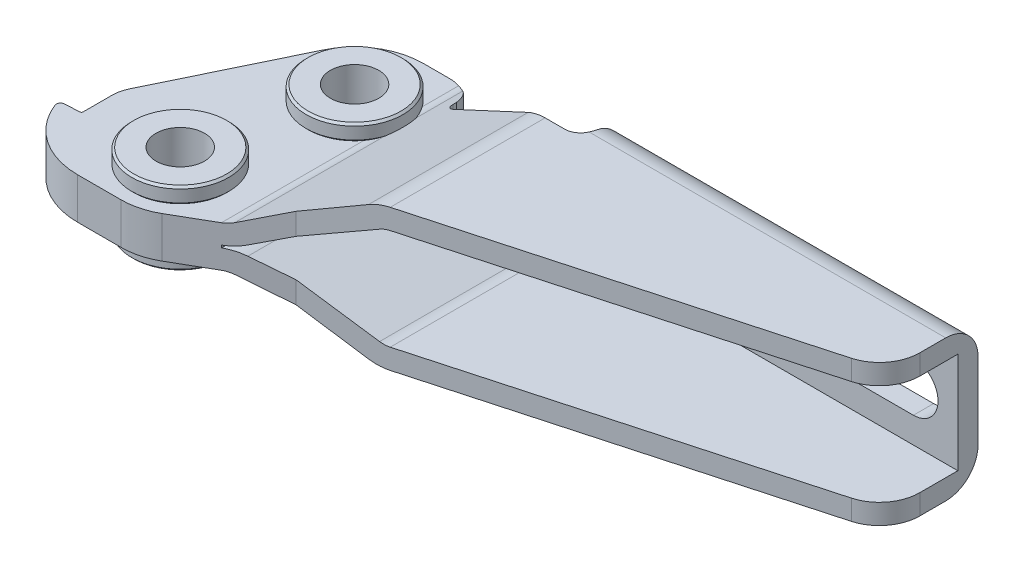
ISO-10303-21;
HEADER;
FILE_DESCRIPTION(('STEP AP214'),'2;1');
FILE_NAME('part.step','',(''),(''),'','','');
FILE_SCHEMA(('AUTOMOTIVE_DESIGN { 1 0 10303 214 1 1 1 1 }'));
ENDSEC;
DATA;
#1=APPLICATION_CONTEXT('core data for automotive mechanical design processes');
#2=APPLICATION_PROTOCOL_DEFINITION('international standard','automotive_design',2000,#1);
#3=PRODUCT_CONTEXT('',#1,'mechanical');
#4=PRODUCT('Part','Part','',(#3));
#5=PRODUCT_RELATED_PRODUCT_CATEGORY('part','',(#4));
#6=PRODUCT_DEFINITION_FORMATION('','',#4);
#7=PRODUCT_DEFINITION_CONTEXT('part definition',#1,'design');
#8=PRODUCT_DEFINITION('design','',#6,#7);
#9=PRODUCT_DEFINITION_SHAPE('','',#8);
#10=(LENGTH_UNIT() NAMED_UNIT(*) SI_UNIT(.MILLI.,.METRE.));
#11=(NAMED_UNIT(*) PLANE_ANGLE_UNIT() SI_UNIT($,.RADIAN.));
#12=(NAMED_UNIT(*) SI_UNIT($,.STERADIAN.) SOLID_ANGLE_UNIT());
#13=UNCERTAINTY_MEASURE_WITH_UNIT(LENGTH_MEASURE(1.E-05),#10,'distance_accuracy_value','');
#14=(GEOMETRIC_REPRESENTATION_CONTEXT(3) GLOBAL_UNCERTAINTY_ASSIGNED_CONTEXT((#13)) GLOBAL_UNIT_ASSIGNED_CONTEXT((#10,
#11,#12)) REPRESENTATION_CONTEXT('',''));
#15=CARTESIAN_POINT('',(0.,0.,0.));
#16=DIRECTION('',(0.,0.,1.));
#17=DIRECTION('',(1.,0.,0.));
#18=AXIS2_PLACEMENT_3D('',#15,#16,#17);
#19=CARTESIAN_POINT('',(4.6,0.15,26.63));
#20=DIRECTION('',(1.,0.,0.));
#21=DIRECTION('',(0.,1.,0.));
#22=AXIS2_PLACEMENT_3D('',#19,#20,#21);
#23=PLANE('',#22);
#24=DIRECTION('',(0.,1.,0.));
#25=VECTOR('',#24,1.);
#26=CARTESIAN_POINT('',(4.6,-20.8134559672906,-3.45));
#27=LINE('',#26,#25);
#28=CARTESIAN_POINT('',(4.6,-0.15,-3.45));
#29=VERTEX_POINT('',#28);
#30=CARTESIAN_POINT('',(4.6,0.15,-3.45));
#31=VERTEX_POINT('',#30);
#32=EDGE_CURVE('E580',#29,#31,#27,.T.);
#33=ORIENTED_EDGE('',*,*,#32,.F.);
#34=DIRECTION('',(0.,0.,-1.));
#35=VECTOR('',#34,1.);
#36=CARTESIAN_POINT('',(4.6,-0.15,26.63));
#37=LINE('',#36,#35);
#38=CARTESIAN_POINT('',(4.6,-0.15,-6.71));
#39=VERTEX_POINT('',#38);
#40=EDGE_CURVE('E416',#29,#39,#37,.T.);
#41=ORIENTED_EDGE('',*,*,#40,.T.);
#42=DIRECTION('',(0.,-1.,0.));
#43=VECTOR('',#42,1.);
#44=CARTESIAN_POINT('',(4.6,0.15,-6.71));
#45=LINE('',#44,#43);
#46=CARTESIAN_POINT('',(4.6,0.15,-6.71));
#47=VERTEX_POINT('',#46);
#48=EDGE_CURVE('E583',#47,#39,#45,.T.);
#49=ORIENTED_EDGE('',*,*,#48,.F.);
#50=DIRECTION('',(0.,0.,-1.));
#51=VECTOR('',#50,1.);
#52=CARTESIAN_POINT('',(4.6,0.15,26.63));
#53=LINE('',#52,#51);
#54=EDGE_CURVE('E415',#31,#47,#53,.T.);
#55=ORIENTED_EDGE('',*,*,#54,.F.);
#56=EDGE_LOOP('',(#33,#41,#49,#55));
#57=FACE_BOUND('',#56,.T.);
#58=ADVANCED_FACE('F14',(#57),#23,.T.);
#59=CARTESIAN_POINT('',(4.6,-2.55,26.84));
#60=DIRECTION('',(0.,-1.,0.));
#61=DIRECTION('',(0.,0.,1.));
#62=AXIS2_PLACEMENT_3D('',#59,#60,#61);
#63=PLANE('',#62);
#64=CARTESIAN_POINT('',(-4.04999999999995,-2.55,17.54));
#65=DIRECTION('',(0.,-1.,0.));
#66=DIRECTION('',(0.,0.,1.));
#67=AXIS2_PLACEMENT_3D('',#64,#65,#66);
#68=CIRCLE('',#67,5.85);
#69=CARTESIAN_POINT('',(-4.04999999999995,-2.55,23.39));
#70=VERTEX_POINT('',#69);
#71=EDGE_CURVE('E966',#70,#70,#68,.T.);
#72=ORIENTED_EDGE('',*,*,#71,.F.);
#73=EDGE_LOOP('',(#72));
#74=FACE_BOUND('',#73,.T.);
#75=CARTESIAN_POINT('',(0.,-2.55,0.));
#76=DIRECTION('',(0.,-1.,0.));
#77=DIRECTION('',(0.,0.,1.));
#78=AXIS2_PLACEMENT_3D('',#75,#76,#77);
#79=CIRCLE('',#78,5.85);
#80=CARTESIAN_POINT('',(4.6,-2.55,3.61420807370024));
#81=VERTEX_POINT('',#80);
#82=CARTESIAN_POINT('',(4.6,-2.55,-3.61420807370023));
#83=VERTEX_POINT('',#82);
#84=EDGE_CURVE('E481',#81,#83,#79,.T.);
#85=ORIENTED_EDGE('',*,*,#84,.F.);
#86=DIRECTION('',(0.,0.,-1.));
#87=VECTOR('',#86,1.);
#88=CARTESIAN_POINT('',(4.6,-2.55,26.84));
#89=LINE('',#88,#87);
#90=CARTESIAN_POINT('',(4.6,-2.55,21.0935244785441));
#91=VERTEX_POINT('',#90);
#92=EDGE_CURVE('E1123',#91,#81,#89,.T.);
#93=ORIENTED_EDGE('',*,*,#92,.F.);
#94=DIRECTION('',(0.866025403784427,0.,-0.500000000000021));
#95=VECTOR('',#94,1.);
#96=CARTESIAN_POINT('',(-0.0499999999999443,-2.55,23.778203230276));
#97=LINE('',#96,#95);
#98=CARTESIAN_POINT('',(-0.0499999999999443,-2.55,23.778203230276));
#99=VERTEX_POINT('',#98);
#100=EDGE_CURVE('E917',#99,#91,#97,.T.);
#101=ORIENTED_EDGE('',*,*,#100,.F.);
#102=CARTESIAN_POINT('',(-4.0499999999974,-2.55,16.8500000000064));
#103=DIRECTION('',(0.,-1.,0.));
#104=DIRECTION('',(0.,0.,1.));
#105=AXIS2_PLACEMENT_3D('',#102,#103,#104);
#106=CIRCLE('',#105,7.99999999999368);
#107=CARTESIAN_POINT('',(-4.0499999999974,-2.55,24.85));
#108=VERTEX_POINT('',#107);
#109=EDGE_CURVE('E1156',#108,#99,#106,.F.);
#110=ORIENTED_EDGE('',*,*,#109,.F.);
#111=DIRECTION('',(1.,0.,0.));
#112=VECTOR('',#111,1.);
#113=CARTESIAN_POINT('',(-9.45,-2.55,24.85));
#114=LINE('',#113,#112);
#115=CARTESIAN_POINT('',(-9.45,-2.55,24.85));
#116=VERTEX_POINT('',#115);
#117=EDGE_CURVE('E1159',#116,#108,#114,.T.);
#118=ORIENTED_EDGE('',*,*,#117,.F.);
#119=CARTESIAN_POINT('',(-9.45000000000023,-2.55,15.3400000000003));
#120=DIRECTION('',(0.,-1.,0.));
#121=DIRECTION('',(0.,0.,1.));
#122=AXIS2_PLACEMENT_3D('',#119,#120,#121);
#123=CIRCLE('',#122,9.50999999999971);
#124=CARTESIAN_POINT('',(-18.3248779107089,-2.55,18.75711019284));
#125=VERTEX_POINT('',#124);
#126=EDGE_CURVE('E1162',#125,#116,#123,.F.);
#127=ORIENTED_EDGE('',*,*,#126,.F.);
#128=CARTESIAN_POINT('',(-17.8582702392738,-2.55,18.5774514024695));
#129=DIRECTION('',(0.,-1.,0.));
#130=DIRECTION('',(0.,0.,1.));
#131=AXIS2_PLACEMENT_3D('',#128,#129,#130);
#132=CIRCLE('',#131,0.499999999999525);
#133=CARTESIAN_POINT('',(-17.8872536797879,-2.55,18.078292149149));
#134=VERTEX_POINT('',#133);
#135=EDGE_CURVE('E1165',#134,#125,#132,.F.);
#136=ORIENTED_EDGE('',*,*,#135,.F.);
#137=DIRECTION('',(-0.998318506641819,0.,0.0579668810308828));
#138=VECTOR('',#137,1.);
#139=CARTESIAN_POINT('',(-16.038406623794,-2.55,17.970939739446));
#140=LINE('',#139,#138);
#141=CARTESIAN_POINT('',(-16.038406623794,-2.55,17.970939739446));
#142=VERTEX_POINT('',#141);
#143=EDGE_CURVE('E1168',#142,#134,#140,.T.);
#144=ORIENTED_EDGE('',*,*,#143,.F.);
#145=CARTESIAN_POINT('',(-16.05,-2.55,17.7712760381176));
#146=DIRECTION('',(0.,-1.,0.));
#147=DIRECTION('',(0.,0.,1.));
#148=AXIS2_PLACEMENT_3D('',#145,#146,#147);
#149=CIRCLE('',#148,0.200000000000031);
#150=CARTESIAN_POINT('',(-15.85,-2.55,17.771276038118));
#151=VERTEX_POINT('',#150);
#152=EDGE_CURVE('E1171',#151,#142,#149,.T.);
#153=ORIENTED_EDGE('',*,*,#152,.F.);
#154=DIRECTION('',(0.,0.,1.));
#155=VECTOR('',#154,1.);
#156=CARTESIAN_POINT('',(-15.85,-2.55,14.180755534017));
#157=LINE('',#156,#155);
#158=CARTESIAN_POINT('',(-15.85,-2.55,14.180755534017));
#159=VERTEX_POINT('',#158);
#160=EDGE_CURVE('E1174',#159,#151,#157,.T.);
#161=ORIENTED_EDGE('',*,*,#160,.F.);
#162=CARTESIAN_POINT('',(-11.8500000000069,-2.55,14.1807555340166));
#163=DIRECTION('',(0.,-1.,0.));
#164=DIRECTION('',(0.,0.,1.));
#165=AXIS2_PLACEMENT_3D('',#162,#163,#164);
#166=CIRCLE('',#165,3.99999999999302);
#167=CARTESIAN_POINT('',(-15.451578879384,-2.55,12.440459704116));
#168=VERTEX_POINT('',#167);
#169=EDGE_CURVE('E1177',#168,#159,#166,.F.);
#170=ORIENTED_EDGE('',*,*,#169,.F.);
#171=DIRECTION('',(-0.435073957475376,0.,0.900394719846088));
#172=VECTOR('',#171,1.);
#173=CARTESIAN_POINT('',(-7.65335511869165,-2.55,-3.69812863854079));
#174=LINE('',#173,#172);
#175=CARTESIAN_POINT('',(-7.65335511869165,-2.55,-3.69812863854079));
#176=VERTEX_POINT('',#175);
#177=EDGE_CURVE('E1180',#176,#168,#174,.T.);
#178=ORIENTED_EDGE('',*,*,#177,.F.);
#179=CARTESIAN_POINT('',(0.,-2.55,0.));
#180=DIRECTION('',(0.,-1.,0.));
#181=DIRECTION('',(0.,0.,1.));
#182=AXIS2_PLACEMENT_3D('',#179,#180,#181);
#183=CIRCLE('',#182,8.5);
#184=CARTESIAN_POINT('',(0.,-2.55,-8.5));
#185=VERTEX_POINT('',#184);
#186=EDGE_CURVE('E1107',#185,#176,#183,.F.);
#187=ORIENTED_EDGE('',*,*,#186,.F.);
#188=DIRECTION('',(-1.,0.,0.));
#189=VECTOR('',#188,1.);
#190=CARTESIAN_POINT('',(3.31000000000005,-2.55,-8.5));
#191=LINE('',#190,#189);
#192=CARTESIAN_POINT('',(3.31000000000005,-2.55,-8.5));
#193=VERTEX_POINT('',#192);
#194=EDGE_CURVE('E1102',#193,#185,#191,.T.);
#195=ORIENTED_EDGE('',*,*,#194,.F.);
#196=CARTESIAN_POINT('',(3.31000000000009,-2.55,-4.5));
#197=DIRECTION('',(0.,-1.,0.));
#198=DIRECTION('',(0.,0.,1.));
#199=AXIS2_PLACEMENT_3D('',#196,#197,#198);
#200=CIRCLE('',#199,4.);
#201=CARTESIAN_POINT('',(4.6,-2.55,-8.2862778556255));
#202=VERTEX_POINT('',#201);
#203=EDGE_CURVE('E1184',#202,#193,#200,.F.);
#204=ORIENTED_EDGE('',*,*,#203,.F.);
#205=EDGE_CURVE('E1122',#83,#202,#89,.T.);
#206=ORIENTED_EDGE('',*,*,#205,.F.);
#207=EDGE_LOOP('',(#85,#93,#101,#110,#118,#127,#136,#144,#153,#161,#170,#178,#187,#195,#204,#206));
#208=FACE_BOUND('',#207,.T.);
#209=ADVANCED_FACE('F460',(#74,#208),#63,.T.);
#210=CARTESIAN_POINT('',(4.59999999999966,-5.05000000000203,26.84));
#211=DIRECTION('',(0.,0.,-1.));
#212=DIRECTION('',(0.,-1.,0.));
#213=AXIS2_PLACEMENT_3D('',#210,#211,#212);
#214=CYLINDRICAL_SURFACE('',#213,2.50000000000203);
#215=CARTESIAN_POINT('',(4.49444891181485,-2.5522292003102,-3.74813494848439));
#216=CARTESIAN_POINT('',(4.57995134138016,-2.5486416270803,-3.64007627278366));
#217=CARTESIAN_POINT('',(4.6650536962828,-2.54941680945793,-3.5315766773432));
#218=CARTESIAN_POINT('',(4.83386680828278,-2.55952654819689,-3.31458028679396));
#219=CARTESIAN_POINT('',(4.9175817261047,-2.56882738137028,-3.20608516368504));
#220=CARTESIAN_POINT('',(5.08370894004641,-2.59579692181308,-2.98912024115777));
#221=CARTESIAN_POINT('',(5.16612119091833,-2.61346591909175,-2.88065044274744));
#222=CARTESIAN_POINT('',(5.28913771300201,-2.64648150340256,-2.71848730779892));
#223=CARTESIAN_POINT('',(5.33012500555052,-2.65860312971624,-2.66441462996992));
#224=CARTESIAN_POINT('',(5.41197604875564,-2.6851457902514,-2.55673497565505));
#225=CARTESIAN_POINT('',(5.45283978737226,-2.699567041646,-2.50312804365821));
#226=CARTESIAN_POINT('',(5.49370518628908,-2.7152,-2.44986415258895));
#227=B_SPLINE_CURVE_WITH_KNOTS('',3,(#215,#216,#217,#218,#219,#220,#221,#222,#223,#224,#225,
#226),.UNSPECIFIED.,.F.,.F.,(4,2,2,2,2,4),(0.,0.413426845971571,0.825225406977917,
1.23703824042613,1.44378071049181,1.65054271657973),.UNSPECIFIED.);
#228=CARTESIAN_POINT('',(5.45293610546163,-2.7,-2.50309564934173));
#229=VERTEX_POINT('',#228);
#230=EDGE_CURVE('E480',#83,#229,#227,.T.);
#231=ORIENTED_EDGE('',*,*,#230,.F.);
#232=ORIENTED_EDGE('',*,*,#205,.T.);
#233=CARTESIAN_POINT('',(5.65351088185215,-2.7828178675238,-7.74159786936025));
#234=CARTESIAN_POINT('',(5.59685152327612,-2.75648848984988,-7.78256797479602));
#235=CARTESIAN_POINT('',(5.53852954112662,-2.73197173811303,-7.8224614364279));
#236=CARTESIAN_POINT('',(5.41864799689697,-2.68696779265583,-7.89980685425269));
#237=CARTESIAN_POINT('',(5.35708320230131,-2.66648738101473,-7.93725463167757));
#238=CARTESIAN_POINT('',(5.23227208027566,-2.63042052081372,-8.0085513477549));
#239=CARTESIAN_POINT('',(5.16908516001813,-2.61474326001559,-8.04245786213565));
#240=CARTESIAN_POINT('',(5.04021929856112,-2.58818572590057,-8.10715006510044));
#241=CARTESIAN_POINT('',(4.97454281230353,-2.57730085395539,-8.13793872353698));
#242=CARTESIAN_POINT('',(4.85775496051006,-2.56281177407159,-8.18882557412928));
#243=CARTESIAN_POINT('',(4.80710855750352,-2.55806755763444,-8.20967171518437));
#244=CARTESIAN_POINT('',(4.70444282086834,-2.55164828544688,-8.24947910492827));
#245=CARTESIAN_POINT('',(4.65241594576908,-2.54999699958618,-8.26842470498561));
#246=CARTESIAN_POINT('',(4.6,-2.55,-8.2862778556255));
#247=B_SPLINE_CURVE_WITH_KNOTS('',3,(#233,#234,#235,#236,#237,#238,#239,#240,#241,#242,#243,
#244,#245,#246),.UNSPECIFIED.,.F.,.F.,(4,2,2,2,2,2,4),(0.,0.224139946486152,0.448653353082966,
0.668614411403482,0.88836393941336,1.05315850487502,1.2192144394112),.UNSPECIFIED.);
#248=CARTESIAN_POINT('',(5.65351088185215,-2.7828178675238,-7.74159786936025));
#249=VERTEX_POINT('',#248);
#250=EDGE_CURVE('E496',#249,#202,#247,.T.);
#251=ORIENTED_EDGE('',*,*,#250,.F.);
#252=DIRECTION('',(0.,0.,-1.));
#253=VECTOR('',#252,1.);
#254=CARTESIAN_POINT('',(5.65351088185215,-2.7828178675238,26.84));
#255=LINE('',#254,#253);
#256=CARTESIAN_POINT('',(5.65351088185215,-2.7828178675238,-2.0094314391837));
#257=VERTEX_POINT('',#256);
#258=EDGE_CURVE('E1126',#257,#249,#255,.T.);
#259=ORIENTED_EDGE('',*,*,#258,.F.);
#260=CARTESIAN_POINT('',(5.45293610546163,-2.7,-2.50309564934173));
#261=CARTESIAN_POINT('',(5.47148250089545,-2.70673156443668,-2.46269262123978));
#262=CARTESIAN_POINT('',(5.48957460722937,-2.71354647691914,-2.42209516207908));
#263=CARTESIAN_POINT('',(5.52483762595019,-2.72727889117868,-2.34054309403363));
#264=CARTESIAN_POINT('',(5.54200897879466,-2.7341963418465,-2.29958866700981));
#265=CARTESIAN_POINT('',(5.57543577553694,-2.74807633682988,-2.21731537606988));
#266=CARTESIAN_POINT('',(5.5916912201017,-2.7550388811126,-2.17599651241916));
#267=CARTESIAN_POINT('',(5.62328933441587,-2.76895266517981,-2.09298593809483));
#268=CARTESIAN_POINT('',(5.6386315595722,-2.77590389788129,-2.0512940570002));
#269=CARTESIAN_POINT('',(5.65351088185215,-2.7828178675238,-2.00943143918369));
#270=B_SPLINE_CURVE_WITH_KNOTS('',3,(#260,#261,#262,#263,#264,#265,#266,#267,#268,#269),
.UNSPECIFIED.,.F.,.F.,(4,2,2,2,4),(0.,0.134886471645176,0.269707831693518,0.404529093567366,
0.539415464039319),.UNSPECIFIED.);
#271=EDGE_CURVE('E473',#229,#257,#270,.T.);
#272=ORIENTED_EDGE('',*,*,#271,.F.);
#273=EDGE_LOOP('',(#231,#232,#251,#259,#272));
#274=FACE_BOUND('',#273,.T.);
#275=ADVANCED_FACE('F483',(#274),#214,.F.);
#276=CARTESIAN_POINT('',(5.49370518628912,-2.7152,2.449864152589));
#277=CARTESIAN_POINT('',(5.45283978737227,-2.699567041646,2.50312804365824));
#278=CARTESIAN_POINT('',(5.41197604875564,-2.6851457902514,2.55673497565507));
#279=CARTESIAN_POINT('',(5.3301250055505,-2.65860312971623,2.66441462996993));
#280=CARTESIAN_POINT('',(5.289137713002,-2.64648150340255,2.71848730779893));
#281=CARTESIAN_POINT('',(5.16612119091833,-2.61346591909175,2.88065044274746));
#282=CARTESIAN_POINT('',(5.0837089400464,-2.59579692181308,2.98912024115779));
#283=CARTESIAN_POINT('',(4.91758172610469,-2.56882738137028,3.20608516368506));
#284=CARTESIAN_POINT('',(4.83386680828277,-2.55952654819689,3.31458028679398));
#285=CARTESIAN_POINT('',(4.66505369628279,-2.54941680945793,3.53157667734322));
#286=CARTESIAN_POINT('',(4.57995134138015,-2.5486416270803,3.64007627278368));
#287=CARTESIAN_POINT('',(4.49444891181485,-2.5522292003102,3.74813494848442));
#288=B_SPLINE_CURVE_WITH_KNOTS('',3,(#276,#277,#278,#279,#280,#281,#282,#283,#284,#285,#286,
#287),.UNSPECIFIED.,.F.,.F.,(4,2,2,2,2,4),(0.,0.206762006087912,0.413504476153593,
0.825317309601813,1.23711587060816,1.65054271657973),.UNSPECIFIED.);
#289=CARTESIAN_POINT('',(5.45293610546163,-2.7,2.50309564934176));
#290=VERTEX_POINT('',#289);
#291=EDGE_CURVE('E508',#290,#81,#288,.T.);
#292=ORIENTED_EDGE('',*,*,#291,.F.);
#293=CARTESIAN_POINT('',(5.65351088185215,-2.7828178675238,2.0094314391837));
#294=CARTESIAN_POINT('',(5.63863155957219,-2.77590389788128,2.05129405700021));
#295=CARTESIAN_POINT('',(5.62328933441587,-2.76895266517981,2.09298593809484));
#296=CARTESIAN_POINT('',(5.59169122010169,-2.7550388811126,2.17599651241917));
#297=CARTESIAN_POINT('',(5.57543577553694,-2.74807633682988,2.21731537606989));
#298=CARTESIAN_POINT('',(5.54200897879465,-2.7341963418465,2.29958866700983));
#299=CARTESIAN_POINT('',(5.52483762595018,-2.72727889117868,2.34054309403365));
#300=CARTESIAN_POINT('',(5.48957460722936,-2.71354647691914,2.4220951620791));
#301=CARTESIAN_POINT('',(5.47148250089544,-2.70673156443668,2.4626926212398));
#302=CARTESIAN_POINT('',(5.45293610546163,-2.7,2.50309564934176));
#303=B_SPLINE_CURVE_WITH_KNOTS('',3,(#293,#294,#295,#296,#297,#298,#299,#300,#301,#302),
.UNSPECIFIED.,.F.,.F.,(4,2,2,2,4),(0.,0.134886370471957,0.26970763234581,0.404528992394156,
0.539415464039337),.UNSPECIFIED.);
#304=CARTESIAN_POINT('',(5.65351088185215,-2.7828178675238,2.0094314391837));
#305=VERTEX_POINT('',#304);
#306=EDGE_CURVE('E465',#305,#290,#303,.T.);
#307=ORIENTED_EDGE('',*,*,#306,.F.);
#308=CARTESIAN_POINT('',(5.65351088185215,-2.7828178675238,20.4852796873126));
#309=VERTEX_POINT('',#308);
#310=EDGE_CURVE('E1127',#309,#305,#255,.T.);
#311=ORIENTED_EDGE('',*,*,#310,.F.);
#312=CARTESIAN_POINT('',(4.59999999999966,-5.05000000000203,21.0935244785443));
#313=DIRECTION('',(0.50000000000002,0.,0.866025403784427));
#314=DIRECTION('',(0.866025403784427,0.,-0.500000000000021));
#315=AXIS2_PLACEMENT_3D('',#312,#313,#314);
#316=ELLIPSE('',#315,2.88675134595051,2.50000000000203);
#317=EDGE_CURVE('E920',#91,#309,#316,.F.);
#318=ORIENTED_EDGE('',*,*,#317,.F.);
#319=ORIENTED_EDGE('',*,*,#92,.T.);
#320=EDGE_LOOP('',(#292,#307,#311,#318,#319));
#321=FACE_BOUND('',#320,.T.);
#322=ADVANCED_FACE('F488',(#321),#214,.F.);
#323=CARTESIAN_POINT('',(17.4929782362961,-8.2843642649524,26.84));
#324=DIRECTION('',(-0.421404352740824,-0.906872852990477,0.));
#325=DIRECTION('',(0.906872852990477,-0.421404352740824,0.));
#326=AXIS2_PLACEMENT_3D('',#323,#324,#325);
#327=PLANE('',#326);
#328=CARTESIAN_POINT('',(0.,-0.155752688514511,0.));
#329=DIRECTION('',(-0.421404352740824,-0.906872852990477,0.));
#330=DIRECTION('',(0.906872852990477,-0.421404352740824,0.));
#331=AXIS2_PLACEMENT_3D('',#328,#329,#330);
#332=ELLIPSE('',#331,6.61614247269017,6.);
#333=EDGE_CURVE('E569',#257,#305,#332,.T.);
#334=ORIENTED_EDGE('',*,*,#333,.F.);
#335=ORIENTED_EDGE('',*,*,#258,.T.);
#336=CARTESIAN_POINT('',(3.31000000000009,-1.69383865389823,-4.5));
#337=DIRECTION('',(-0.421404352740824,-0.906872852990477,0.));
#338=DIRECTION('',(-0.906872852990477,0.421404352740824,0.));
#339=AXIS2_PLACEMENT_3D('',#336,#337,#338);
#340=ELLIPSE('',#339,4.41076164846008,4.);
#341=CARTESIAN_POINT('',(7.21110255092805,-3.50659728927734,-5.38396769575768));
#342=VERTEX_POINT('',#341);
#343=EDGE_CURVE('E1144',#342,#249,#340,.F.);
#344=ORIENTED_EDGE('',*,*,#343,.F.);
#345=DIRECTION('',(0.,0.,-1.));
#346=VECTOR('',#345,1.);
#347=CARTESIAN_POINT('',(7.21110255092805,-3.50659728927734,-5.));
#348=LINE('',#347,#346);
#349=CARTESIAN_POINT('',(7.21110255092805,-3.50659728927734,-5.));
#350=VERTEX_POINT('',#349);
#351=EDGE_CURVE('E1147',#350,#342,#348,.T.);
#352=ORIENTED_EDGE('',*,*,#351,.F.);
#353=CARTESIAN_POINT('',(8.21110255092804,-3.97127582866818,-5.));
#354=DIRECTION('',(-0.421404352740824,-0.906872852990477,0.));
#355=DIRECTION('',(-0.906872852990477,0.421404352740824,0.));
#356=AXIS2_PLACEMENT_3D('',#353,#354,#355);
#357=ELLIPSE('',#356,1.10269041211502,1.);
#358=CARTESIAN_POINT('',(8.21110255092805,-3.97127582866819,-4.));
#359=VERTEX_POINT('',#358);
#360=EDGE_CURVE('E1150',#359,#350,#357,.T.);
#361=ORIENTED_EDGE('',*,*,#360,.F.);
#362=DIRECTION('',(-0.906872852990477,0.421404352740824,0.));
#363=VECTOR('',#362,1.);
#364=CARTESIAN_POINT('',(21.377583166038,-10.0894568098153,-4.));
#365=LINE('',#364,#363);
#366=CARTESIAN_POINT('',(17.4929782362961,-8.2843642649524,-4.));
#367=VERTEX_POINT('',#366);
#368=EDGE_CURVE('E1153',#367,#359,#365,.T.);
#369=ORIENTED_EDGE('',*,*,#368,.F.);
#370=DIRECTION('',(0.,0.,-1.));
#371=VECTOR('',#370,1.);
#372=CARTESIAN_POINT('',(17.4929782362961,-8.2843642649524,26.84));
#373=LINE('',#372,#371);
#374=CARTESIAN_POINT('',(17.4929782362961,-8.2843642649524,15.7649154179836));
#375=VERTEX_POINT('',#374);
#376=EDGE_CURVE('E1130',#375,#367,#373,.T.);
#377=ORIENTED_EDGE('',*,*,#376,.F.);
#378=DIRECTION('',(0.879662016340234,-0.408760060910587,-0.243125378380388));
#379=VECTOR('',#378,1.);
#380=CARTESIAN_POINT('',(11.8067581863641,-5.64209983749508,17.3365012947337));
#381=LINE('',#380,#379);
#382=CARTESIAN_POINT('',(10.465073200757,-5.01864761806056,17.70732288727));
#383=VERTEX_POINT('',#382);
#384=EDGE_CURVE('E914',#383,#375,#381,.T.);
#385=ORIENTED_EDGE('',*,*,#384,.F.);
#386=DIRECTION('',(0.803411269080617,-0.373327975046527,-0.463849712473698));
#387=VECTOR('',#386,1.);
#388=CARTESIAN_POINT('',(2.53469201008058,-1.33356966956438,22.2859306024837));
#389=LINE('',#388,#387);
#390=EDGE_CURVE('E1141',#309,#383,#389,.T.);
#391=ORIENTED_EDGE('',*,*,#390,.F.);
#392=ORIENTED_EDGE('',*,*,#310,.T.);
#393=EDGE_LOOP('',(#334,#335,#344,#352,#361,#369,#377,#385,#391,#392));
#394=FACE_BOUND('',#393,.T.);
#395=ADVANCED_FACE('F491',(#394),#327,.T.);
#396=CARTESIAN_POINT('',(5.65351088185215,2.7828178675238,26.84));
#397=DIRECTION('',(-0.421404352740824,0.906872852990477,0.));
#398=DIRECTION('',(-0.906872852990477,-0.421404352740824,0.));
#399=AXIS2_PLACEMENT_3D('',#396,#397,#398);
#400=PLANE('',#399);
#401=CARTESIAN_POINT('',(1.98877471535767,1.07989361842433,0.));
#402=DIRECTION('',(-0.421404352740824,0.906872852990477,0.));
#403=DIRECTION('',(0.906872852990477,0.421404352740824,0.));
#404=AXIS2_PLACEMENT_3D('',#401,#402,#403);
#405=ELLIPSE('',#404,4.71939765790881,3.78975784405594);
#406=CARTESIAN_POINT('',(5.69048726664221,2.8,-1.90219732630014));
#407=VERTEX_POINT('',#406);
#408=CARTESIAN_POINT('',(5.65351088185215,2.7828178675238,-1.95753016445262));
#409=VERTEX_POINT('',#408);
#410=EDGE_CURVE('E515',#407,#409,#405,.T.);
#411=ORIENTED_EDGE('',*,*,#410,.F.);
#412=CARTESIAN_POINT('',(0.,0.155752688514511,0.));
#413=DIRECTION('',(-0.421404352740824,0.906872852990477,0.));
#414=DIRECTION('',(0.906872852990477,0.421404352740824,0.));
#415=AXIS2_PLACEMENT_3D('',#412,#413,#414);
#416=ELLIPSE('',#415,6.61614247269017,6.);
#417=CARTESIAN_POINT('',(5.69048726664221,2.8,1.90219732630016));
#418=VERTEX_POINT('',#417);
#419=EDGE_CURVE('E734',#418,#407,#416,.T.);
#420=ORIENTED_EDGE('',*,*,#419,.F.);
#421=CARTESIAN_POINT('',(5.65351088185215,2.7828178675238,1.95753016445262));
#422=VERTEX_POINT('',#421);
#423=EDGE_CURVE('E733',#422,#418,#405,.T.);
#424=ORIENTED_EDGE('',*,*,#423,.F.);
#425=DIRECTION('',(0.,0.,-1.));
#426=VECTOR('',#425,1.);
#427=CARTESIAN_POINT('',(5.65351088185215,2.7828178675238,26.84));
#428=LINE('',#427,#426);
#429=CARTESIAN_POINT('',(5.65351088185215,2.7828178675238,20.4852796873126));
#430=VERTEX_POINT('',#429);
#431=EDGE_CURVE('E1251',#430,#422,#428,.T.);
#432=ORIENTED_EDGE('',*,*,#431,.F.);
#433=DIRECTION('',(-0.803411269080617,-0.373327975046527,0.463849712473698));
#434=VECTOR('',#433,1.);
#435=CARTESIAN_POINT('',(-2.7141862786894,-1.10547142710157,25.3163718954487));
#436=LINE('',#435,#434);
#437=CARTESIAN_POINT('',(10.465073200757,5.01864761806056,17.70732288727));
#438=VERTEX_POINT('',#437);
#439=EDGE_CURVE('E1245',#438,#430,#436,.T.);
#440=ORIENTED_EDGE('',*,*,#439,.F.);
#441=DIRECTION('',(-0.879662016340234,-0.408760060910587,0.243125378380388));
#442=VECTOR('',#441,1.);
#443=CARTESIAN_POINT('',(5.51427094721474,2.71811605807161,19.075650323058));
#444=LINE('',#443,#442);
#445=CARTESIAN_POINT('',(17.4929782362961,8.2843642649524,15.7649154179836));
#446=VERTEX_POINT('',#445);
#447=EDGE_CURVE('E923',#446,#438,#444,.T.);
#448=ORIENTED_EDGE('',*,*,#447,.F.);
#449=DIRECTION('',(0.,0.,-1.));
#450=VECTOR('',#449,1.);
#451=CARTESIAN_POINT('',(17.4929782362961,8.2843642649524,26.84));
#452=LINE('',#451,#450);
#453=CARTESIAN_POINT('',(17.4929782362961,8.2843642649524,-4.));
#454=VERTEX_POINT('',#453);
#455=EDGE_CURVE('E1224',#446,#454,#452,.T.);
#456=ORIENTED_EDGE('',*,*,#455,.T.);
#457=DIRECTION('',(0.906872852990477,0.421404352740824,0.));
#458=VECTOR('',#457,1.);
#459=CARTESIAN_POINT('',(14.6897802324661,6.98177831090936,-4.));
#460=LINE('',#459,#458);
#461=CARTESIAN_POINT('',(8.21110255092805,3.97127582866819,-4.));
#462=VERTEX_POINT('',#461);
#463=EDGE_CURVE('E711',#462,#454,#460,.T.);
#464=ORIENTED_EDGE('',*,*,#463,.F.);
#465=CARTESIAN_POINT('',(8.21110255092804,3.97127582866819,-5.));
#466=DIRECTION('',(-0.421404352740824,0.906872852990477,0.));
#467=DIRECTION('',(0.906872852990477,0.421404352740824,0.));
#468=AXIS2_PLACEMENT_3D('',#465,#466,#467);
#469=ELLIPSE('',#468,1.10269041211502,1.);
#470=CARTESIAN_POINT('',(7.21110255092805,3.50659728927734,-5.));
#471=VERTEX_POINT('',#470);
#472=EDGE_CURVE('E1258',#471,#462,#469,.T.);
#473=ORIENTED_EDGE('',*,*,#472,.F.);
#474=DIRECTION('',(0.,0.,1.));
#475=VECTOR('',#474,1.);
#476=CARTESIAN_POINT('',(7.21110255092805,3.50659728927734,-5.));
#477=LINE('',#476,#475);
#478=CARTESIAN_POINT('',(7.21110255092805,3.50659728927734,-5.38396769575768));
#479=VERTEX_POINT('',#478);
#480=EDGE_CURVE('E1253',#479,#471,#477,.T.);
#481=ORIENTED_EDGE('',*,*,#480,.F.);
#482=CARTESIAN_POINT('',(3.31000000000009,1.69383865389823,-4.5));
#483=DIRECTION('',(-0.421404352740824,0.906872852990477,0.));
#484=DIRECTION('',(0.906872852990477,0.421404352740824,0.));
#485=AXIS2_PLACEMENT_3D('',#482,#483,#484);
#486=ELLIPSE('',#485,4.41076164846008,4.);
#487=CARTESIAN_POINT('',(5.65351088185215,2.7828178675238,-7.74159786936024));
#488=VERTEX_POINT('',#487);
#489=EDGE_CURVE('E881',#488,#479,#486,.F.);
#490=ORIENTED_EDGE('',*,*,#489,.F.);
#491=EDGE_CURVE('E1263',#409,#488,#428,.T.);
#492=ORIENTED_EDGE('',*,*,#491,.F.);
#493=EDGE_LOOP('',(#411,#420,#424,#432,#440,#448,#456,#464,#473,#481,#490,#492));
#494=FACE_BOUND('',#493,.T.);
#495=ADVANCED_FACE('F720',(#494),#400,.T.);
#496=CARTESIAN_POINT('',(4.59999999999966,5.05000000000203,26.84));
#497=DIRECTION('',(0.,0.,-1.));
#498=DIRECTION('',(0.,-1.,0.));
#499=AXIS2_PLACEMENT_3D('',#496,#497,#498);
#500=CYLINDRICAL_SURFACE('',#499,2.50000000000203);
#501=CARTESIAN_POINT('',(4.49444891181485,2.5522292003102,3.58999578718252));
#502=CARTESIAN_POINT('',(4.54949600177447,2.54990299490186,3.51736061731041));
#503=CARTESIAN_POINT('',(4.60428961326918,2.54940976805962,3.44449457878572));
#504=CARTESIAN_POINT('',(4.71321385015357,2.55197112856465,3.29834545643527));
#505=CARTESIAN_POINT('',(4.7673445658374,2.55502522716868,3.22506243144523));
#506=CARTESIAN_POINT('',(4.92790048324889,2.56927519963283,3.00548715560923));
#507=CARTESIAN_POINT('',(5.03313884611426,2.58553446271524,2.85861551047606));
#508=CARTESIAN_POINT('',(5.18817783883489,2.61959958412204,2.63790322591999));
#509=CARTESIAN_POINT('',(5.2393921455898,2.63256890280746,2.56425846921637));
#510=CARTESIAN_POINT('',(5.34096061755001,2.66174423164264,2.41701597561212));
#511=CARTESIAN_POINT('',(5.39131483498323,2.67795004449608,2.34341823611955));
#512=CARTESIAN_POINT('',(5.49158670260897,2.7137760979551,2.19610372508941));
#513=CARTESIAN_POINT('',(5.54150013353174,2.73341557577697,2.12238873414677));
#514=CARTESIAN_POINT('',(5.64102169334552,2.77642024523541,1.97582976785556));
#515=CARTESIAN_POINT('',(5.69062976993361,2.79978605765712,1.902985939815));
#516=CARTESIAN_POINT('',(5.7402916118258,2.8252,1.8308706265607));
#517=B_SPLINE_CURVE_WITH_KNOTS('',3,(#501,#502,#503,#504,#505,#506,#507,#508,#509,#510,#511,
#512,#513,#514,#515,#516),.UNSPECIFIED.,.F.,.F.,(4,2,2,2,2,2,2,4),(0.,0.273453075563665,
0.54686847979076,1.09049039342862,1.36234940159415,1.63419184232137,1.90760917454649,
2.18107210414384),.UNSPECIFIED.);
#518=CARTESIAN_POINT('',(4.59999999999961,2.55,3.4500000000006));
#519=VERTEX_POINT('',#518);
#520=EDGE_CURVE('E725',#519,#422,#517,.T.);
#521=ORIENTED_EDGE('',*,*,#520,.F.);
#522=DIRECTION('',(0.,0.,-1.));
#523=VECTOR('',#522,1.);
#524=CARTESIAN_POINT('',(4.6,2.55,26.84));
#525=LINE('',#524,#523);
#526=CARTESIAN_POINT('',(4.6,2.55,21.0935244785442));
#527=VERTEX_POINT('',#526);
#528=EDGE_CURVE('E1268',#527,#519,#525,.T.);
#529=ORIENTED_EDGE('',*,*,#528,.F.);
#530=CARTESIAN_POINT('',(4.59999999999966,5.05000000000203,21.0935244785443));
#531=DIRECTION('',(0.50000000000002,0.,0.866025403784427));
#532=DIRECTION('',(0.866025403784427,0.,-0.500000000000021));
#533=AXIS2_PLACEMENT_3D('',#530,#531,#532);
#534=ELLIPSE('',#533,2.88675134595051,2.50000000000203);
#535=EDGE_CURVE('E926',#430,#527,#534,.F.);
#536=ORIENTED_EDGE('',*,*,#535,.F.);
#537=ORIENTED_EDGE('',*,*,#431,.T.);
#538=EDGE_LOOP('',(#521,#529,#536,#537));
#539=FACE_BOUND('',#538,.T.);
#540=ADVANCED_FACE('F719',(#539),#500,.F.);
#541=CARTESIAN_POINT('',(-0.0499999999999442,-8.75,23.778203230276));
#542=DIRECTION('',(0.50000000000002,0.,0.866025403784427));
#543=DIRECTION('',(0.866025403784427,0.,-0.500000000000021));
#544=AXIS2_PLACEMENT_3D('',#541,#542,#543);
#545=PLANE('',#544);
#546=CARTESIAN_POINT('',(4.59999999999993,5.15000000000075,21.0935244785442));
#547=DIRECTION('',(0.50000000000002,0.,0.866025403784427));
#548=DIRECTION('',(0.866025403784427,0.,-0.500000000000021));
#549=AXIS2_PLACEMENT_3D('',#546,#547,#548);
#550=ELLIPSE('',#549,5.77350269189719,5.00000000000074);
#551=CARTESIAN_POINT('',(4.6,0.15,21.0935244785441));
#552=VERTEX_POINT('',#551);
#553=CARTESIAN_POINT('',(6.67543520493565,0.601091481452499,19.8952714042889));
#554=VERTEX_POINT('',#553);
#555=EDGE_CURVE('E954',#552,#554,#550,.T.);
#556=ORIENTED_EDGE('',*,*,#555,.T.);
#557=DIRECTION('',(0.80543171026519,0.367477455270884,-0.465016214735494));
#558=VECTOR('',#557,1.);
#559=CARTESIAN_POINT('',(-1.90951669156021,-3.31578469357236,24.851795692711));
#560=LINE('',#559,#558);
#561=CARTESIAN_POINT('',(10.465073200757,2.33011022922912,17.70732288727));
#562=VERTEX_POINT('',#561);
#563=EDGE_CURVE('E653',#554,#562,#560,.T.);
#564=ORIENTED_EDGE('',*,*,#563,.T.);
#565=DIRECTION('',(0.,1.,0.));
#566=VECTOR('',#565,1.);
#567=CARTESIAN_POINT('',(10.465073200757,-8.75,17.70732288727));
#568=LINE('',#567,#566);
#569=EDGE_CURVE('E1062',#562,#438,#568,.T.);
#570=ORIENTED_EDGE('',*,*,#569,.T.);
#571=ORIENTED_EDGE('',*,*,#439,.T.);
#572=ORIENTED_EDGE('',*,*,#535,.T.);
#573=DIRECTION('',(-0.866025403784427,0.,0.500000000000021));
#574=VECTOR('',#573,1.);
#575=CARTESIAN_POINT('',(-0.0499999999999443,2.55,23.778203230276));
#576=LINE('',#575,#574);
#577=CARTESIAN_POINT('',(-0.0499999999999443,2.55,23.778203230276));
#578=VERTEX_POINT('',#577);
#579=EDGE_CURVE('E929',#527,#578,#576,.T.);
#580=ORIENTED_EDGE('',*,*,#579,.T.);
#581=DIRECTION('',(0.,1.,0.));
#582=VECTOR('',#581,1.);
#583=CARTESIAN_POINT('',(-0.0499999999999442,-8.75,23.778203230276));
#584=LINE('',#583,#582);
#585=EDGE_CURVE('E1066',#99,#578,#584,.T.);
#586=ORIENTED_EDGE('',*,*,#585,.F.);
#587=ORIENTED_EDGE('',*,*,#100,.T.);
#588=ORIENTED_EDGE('',*,*,#317,.T.);
#589=ORIENTED_EDGE('',*,*,#390,.T.);
#590=CARTESIAN_POINT('',(10.465073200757,-2.33011022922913,17.70732288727));
#591=VERTEX_POINT('',#590);
#592=EDGE_CURVE('E1063',#383,#591,#568,.T.);
#593=ORIENTED_EDGE('',*,*,#592,.T.);
#594=DIRECTION('',(-0.80543171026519,0.367477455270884,0.465016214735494));
#595=VECTOR('',#594,1.);
#596=CARTESIAN_POINT('',(3.27009822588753,0.952590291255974,21.8613436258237));
#597=LINE('',#596,#595);
#598=CARTESIAN_POINT('',(6.67543520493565,-0.6010914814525,19.8952714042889));
#599=VERTEX_POINT('',#598);
#600=EDGE_CURVE('E638',#591,#599,#597,.T.);
#601=ORIENTED_EDGE('',*,*,#600,.T.);
#602=CARTESIAN_POINT('',(4.59999999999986,-5.15000000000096,21.0935244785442));
#603=DIRECTION('',(0.50000000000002,0.,0.866025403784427));
#604=DIRECTION('',(0.866025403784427,0.,-0.500000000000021));
#605=AXIS2_PLACEMENT_3D('',#602,#603,#604);
#606=ELLIPSE('',#605,5.77350269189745,5.00000000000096);
#607=CARTESIAN_POINT('',(4.6,-0.15,21.0935244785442));
#608=VERTEX_POINT('',#607);
#609=EDGE_CURVE('E865',#599,#608,#606,.T.);
#610=ORIENTED_EDGE('',*,*,#609,.T.);
#611=DIRECTION('',(0.,1.,0.));
#612=VECTOR('',#611,1.);
#613=CARTESIAN_POINT('',(4.6,-8.75,21.0935244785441));
#614=LINE('',#613,#612);
#615=EDGE_CURVE('E412',#608,#552,#614,.T.);
#616=ORIENTED_EDGE('',*,*,#615,.T.);
#617=EDGE_LOOP('',(#556,#564,#570,#571,#572,#580,#586,#587,#588,#589,#593,#601,#610,#616));
#618=FACE_BOUND('',#617,.T.);
#619=ADVANCED_FACE('F692',(#618),#545,.T.);
#620=CARTESIAN_POINT('',(10.465073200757,-8.75,17.70732288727));
#621=DIRECTION('',(0.266397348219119,0.,0.963863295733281));
#622=DIRECTION('',(0.963863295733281,0.,-0.266397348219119));
#623=AXIS2_PLACEMENT_3D('',#620,#621,#622);
#624=PLANE('',#623);
#625=CARTESIAN_POINT('',(19.5999999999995,3.75000000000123,15.1825662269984));
#626=DIRECTION('',(0.266397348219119,0.,0.963863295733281));
#627=DIRECTION('',(0.963863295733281,0.,-0.266397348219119));
#628=AXIS2_PLACEMENT_3D('',#625,#626,#627);
#629=ELLIPSE('',#628,2.59372881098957,2.49999999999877);
#630=CARTESIAN_POINT('',(18.5622823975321,6.0244542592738,15.4693757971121));
#631=VERTEX_POINT('',#630);
#632=CARTESIAN_POINT('',(19.6,6.25,15.1825662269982));
#633=VERTEX_POINT('',#632);
#634=EDGE_CURVE('E950',#631,#633,#629,.F.);
#635=ORIENTED_EDGE('',*,*,#634,.T.);
#636=DIRECTION('',(0.963863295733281,0.,-0.266397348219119));
#637=VECTOR('',#636,1.);
#638=CARTESIAN_POINT('',(10.465073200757,6.25,17.70732288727));
#639=LINE('',#638,#637);
#640=CARTESIAN_POINT('',(64.3319867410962,6.25,2.8193164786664));
#641=VERTEX_POINT('',#640);
#642=EDGE_CURVE('E602',#633,#641,#639,.T.);
#643=ORIENTED_EDGE('',*,*,#642,.T.);
#644=DIRECTION('',(0.,1.,0.));
#645=VECTOR('',#644,1.);
#646=CARTESIAN_POINT('',(64.3319867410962,-8.75,2.8193164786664));
#647=LINE('',#646,#645);
#648=CARTESIAN_POINT('',(64.3319867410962,8.75,2.8193164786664));
#649=VERTEX_POINT('',#648);
#650=EDGE_CURVE('E1058',#641,#649,#647,.T.);
#651=ORIENTED_EDGE('',*,*,#650,.T.);
#652=DIRECTION('',(0.963863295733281,0.,-0.266397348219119));
#653=VECTOR('',#652,1.);
#654=CARTESIAN_POINT('',(10.465073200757,8.75,17.70732288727));
#655=LINE('',#654,#653);
#656=CARTESIAN_POINT('',(19.599999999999,8.75,15.1825662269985));
#657=VERTEX_POINT('',#656);
#658=EDGE_CURVE('E1198',#657,#649,#655,.T.);
#659=ORIENTED_EDGE('',*,*,#658,.F.);
#660=CARTESIAN_POINT('',(19.599999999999,3.75000000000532,15.1825662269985));
#661=DIRECTION('',(0.266397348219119,0.,0.963863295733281));
#662=DIRECTION('',(0.963863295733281,0.,-0.266397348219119));
#663=AXIS2_PLACEMENT_3D('',#660,#661,#662);
#664=ELLIPSE('',#663,5.18745762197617,4.99999999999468);
#665=EDGE_CURVE('E1228',#657,#446,#664,.T.);
#666=ORIENTED_EDGE('',*,*,#665,.T.);
#667=ORIENTED_EDGE('',*,*,#447,.T.);
#668=ORIENTED_EDGE('',*,*,#569,.F.);
#669=DIRECTION('',(0.882316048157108,0.402555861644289,-0.24385891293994));
#670=VECTOR('',#669,1.);
#671=CARTESIAN_POINT('',(6.52962306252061,0.5345648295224,18.79502223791));
#672=LINE('',#671,#670);
#673=EDGE_CURVE('E947',#562,#631,#672,.T.);
#674=ORIENTED_EDGE('',*,*,#673,.T.);
#675=EDGE_LOOP('',(#635,#643,#651,#659,#666,#667,#668,#674));
#676=FACE_BOUND('',#675,.T.);
#677=ADVANCED_FACE('F1227',(#676),#624,.T.);
#678=CARTESIAN_POINT('',(19.599999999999,3.75000000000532,26.84));
#679=DIRECTION('',(0.,0.,-1.));
#680=DIRECTION('',(0.,-1.,0.));
#681=AXIS2_PLACEMENT_3D('',#678,#679,#680);
#682=CYLINDRICAL_SURFACE('',#681,4.99999999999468);
#683=ORIENTED_EDGE('',*,*,#455,.F.);
#684=ORIENTED_EDGE('',*,*,#665,.F.);
#685=DIRECTION('',(0.,0.,-1.));
#686=VECTOR('',#685,1.);
#687=CARTESIAN_POINT('',(19.6,8.75,26.84));
#688=LINE('',#687,#686);
#689=CARTESIAN_POINT('',(19.6,8.75,-4.));
#690=VERTEX_POINT('',#689);
#691=EDGE_CURVE('E873',#657,#690,#688,.T.);
#692=ORIENTED_EDGE('',*,*,#691,.T.);
#693=CARTESIAN_POINT('',(19.599999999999,3.75000000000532,-4.));
#694=DIRECTION('',(0.,0.,-1.));
#695=DIRECTION('',(0.,-1.,0.));
#696=AXIS2_PLACEMENT_3D('',#693,#694,#695);
#697=CIRCLE('',#696,4.99999999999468);
#698=EDGE_CURVE('E1222',#454,#690,#697,.T.);
#699=ORIENTED_EDGE('',*,*,#698,.F.);
#700=EDGE_LOOP('',(#683,#684,#692,#699));
#701=FACE_BOUND('',#700,.T.);
#702=ADVANCED_FACE('F1288',(#701),#682,.T.);
#703=CARTESIAN_POINT('',(22.,-8.75,-4.));
#704=DIRECTION('',(0.,0.,-1.));
#705=DIRECTION('',(0.,-1.,0.));
#706=AXIS2_PLACEMENT_3D('',#703,#704,#705);
#707=PLANE('',#706);
#708=DIRECTION('',(0.,1.,0.));
#709=VECTOR('',#708,1.);
#710=CARTESIAN_POINT('',(22.,-8.75,-4.));
#711=LINE('',#710,#709);
#712=CARTESIAN_POINT('',(22.,6.25,-4.));
#713=VERTEX_POINT('',#712);
#714=CARTESIAN_POINT('',(22.,8.75,-4.));
#715=VERTEX_POINT('',#714);
#716=EDGE_CURVE('E901',#713,#715,#711,.T.);
#717=ORIENTED_EDGE('',*,*,#716,.F.);
#718=DIRECTION('',(-1.,0.,0.));
#719=VECTOR('',#718,1.);
#720=CARTESIAN_POINT('',(22.,6.25,-4.));
#721=LINE('',#720,#719);
#722=CARTESIAN_POINT('',(19.6,6.25,-4.));
#723=VERTEX_POINT('',#722);
#724=EDGE_CURVE('E611',#713,#723,#721,.T.);
#725=ORIENTED_EDGE('',*,*,#724,.T.);
#726=CARTESIAN_POINT('',(19.5999999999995,3.75000000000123,-4.));
#727=DIRECTION('',(0.,0.,-1.));
#728=DIRECTION('',(0.,-1.,0.));
#729=AXIS2_PLACEMENT_3D('',#726,#727,#728);
#730=CIRCLE('',#729,2.49999999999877);
#731=CARTESIAN_POINT('',(18.5622823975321,6.0244542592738,-4.));
#732=VERTEX_POINT('',#731);
#733=EDGE_CURVE('E668',#723,#732,#730,.F.);
#734=ORIENTED_EDGE('',*,*,#733,.T.);
#735=DIRECTION('',(-0.909781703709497,-0.415087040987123,0.));
#736=VECTOR('',#735,1.);
#737=CARTESIAN_POINT('',(15.8282865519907,4.77707124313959,-4.));
#738=LINE('',#737,#736);
#739=CARTESIAN_POINT('',(8.21110255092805,1.30173825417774,-4.));
#740=VERTEX_POINT('',#739);
#741=EDGE_CURVE('E665',#732,#740,#738,.T.);
#742=ORIENTED_EDGE('',*,*,#741,.T.);
#743=DIRECTION('',(0.,1.,0.));
#744=VECTOR('',#743,1.);
#745=CARTESIAN_POINT('',(8.21110255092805,-8.75,-4.));
#746=LINE('',#745,#744);
#747=EDGE_CURVE('E897',#740,#462,#746,.T.);
#748=ORIENTED_EDGE('',*,*,#747,.T.);
#749=ORIENTED_EDGE('',*,*,#463,.T.);
#750=ORIENTED_EDGE('',*,*,#698,.T.);
#751=DIRECTION('',(-1.,0.,0.));
#752=VECTOR('',#751,1.);
#753=CARTESIAN_POINT('',(22.,8.75,-4.));
#754=LINE('',#753,#752);
#755=EDGE_CURVE('E1194',#715,#690,#754,.T.);
#756=ORIENTED_EDGE('',*,*,#755,.F.);
#757=EDGE_LOOP('',(#717,#725,#734,#742,#748,#749,#750,#756));
#758=FACE_BOUND('',#757,.T.);
#759=ADVANCED_FACE('F829',(#758),#707,.T.);
#760=CARTESIAN_POINT('',(8.21110255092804,-8.75,-5.));
#761=DIRECTION('',(0.,1.,0.));
#762=DIRECTION('',(-1.,0.,0.));
#763=AXIS2_PLACEMENT_3D('',#760,#761,#762);
#764=CYLINDRICAL_SURFACE('',#763,1.);
#765=ORIENTED_EDGE('',*,*,#747,.F.);
#766=CARTESIAN_POINT('',(8.21110255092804,1.30173825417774,-5.));
#767=DIRECTION('',(0.415087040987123,-0.909781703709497,0.));
#768=DIRECTION('',(0.909781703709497,0.415087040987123,0.));
#769=AXIS2_PLACEMENT_3D('',#766,#767,#768);
#770=ELLIPSE('',#769,1.09916477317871,1.);
#771=CARTESIAN_POINT('',(7.21110255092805,0.845489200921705,-5.));
#772=VERTEX_POINT('',#771);
#773=EDGE_CURVE('E662',#740,#772,#770,.T.);
#774=ORIENTED_EDGE('',*,*,#773,.T.);
#775=DIRECTION('',(0.,1.,0.));
#776=VECTOR('',#775,1.);
#777=CARTESIAN_POINT('',(7.21110255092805,-8.75,-5.));
#778=LINE('',#777,#776);
#779=EDGE_CURVE('E888',#772,#471,#778,.T.);
#780=ORIENTED_EDGE('',*,*,#779,.T.);
#781=ORIENTED_EDGE('',*,*,#472,.T.);
#782=EDGE_LOOP('',(#765,#774,#780,#781));
#783=FACE_BOUND('',#782,.T.);
#784=ADVANCED_FACE('F1279',(#783),#764,.F.);
#785=CARTESIAN_POINT('',(7.21110255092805,-8.75,-5.));
#786=DIRECTION('',(1.,0.,0.));
#787=DIRECTION('',(0.,1.,0.));
#788=AXIS2_PLACEMENT_3D('',#785,#786,#787);
#789=PLANE('',#788);
#790=ORIENTED_EDGE('',*,*,#779,.F.);
#791=DIRECTION('',(0.,0.,-1.));
#792=VECTOR('',#791,1.);
#793=CARTESIAN_POINT('',(7.21110255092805,0.845489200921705,-5.));
#794=LINE('',#793,#792);
#795=CARTESIAN_POINT('',(7.21110255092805,0.845489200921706,-5.38396769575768));
#796=VERTEX_POINT('',#795);
#797=EDGE_CURVE('E659',#772,#796,#794,.T.);
#798=ORIENTED_EDGE('',*,*,#797,.T.);
#799=DIRECTION('',(0.,1.,0.));
#800=VECTOR('',#799,1.);
#801=CARTESIAN_POINT('',(7.21110255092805,-8.75,-5.38396769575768));
#802=LINE('',#801,#800);
#803=EDGE_CURVE('E879',#796,#479,#802,.T.);
#804=ORIENTED_EDGE('',*,*,#803,.T.);
#805=ORIENTED_EDGE('',*,*,#480,.T.);
#806=EDGE_LOOP('',(#790,#798,#804,#805));
#807=FACE_BOUND('',#806,.T.);
#808=ADVANCED_FACE('F690',(#807),#789,.T.);
#809=CARTESIAN_POINT('',(3.31000000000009,-8.75,-4.5));
#810=DIRECTION('',(0.,1.,0.));
#811=DIRECTION('',(-1.,0.,0.));
#812=AXIS2_PLACEMENT_3D('',#809,#810,#811);
#813=CYLINDRICAL_SURFACE('',#812,4.);
#814=CARTESIAN_POINT('',(6.644051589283,-0.58690312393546,-6.71));
#815=CARTESIAN_POINT('',(6.6493391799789,-0.589271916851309,-6.70202304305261));
#816=CARTESIAN_POINT('',(6.65459827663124,-0.591638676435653,-6.69402689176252));
#817=CARTESIAN_POINT('',(6.66505948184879,-0.596368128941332,-6.67799620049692));
#818=CARTESIAN_POINT('',(6.670261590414,-0.598730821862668,-6.66996166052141));
#819=CARTESIAN_POINT('',(6.67543520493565,-0.601091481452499,-6.6619079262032));
#820=B_SPLINE_CURVE_WITH_KNOTS('',3,(#814,#815,#816,#817,#818,#819),.UNSPECIFIED.,.F.,.F.,(4,2,
4),(0.,0.0295767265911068,0.0591534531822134),.UNSPECIFIED.);
#821=CARTESIAN_POINT('',(6.644051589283,-0.58690312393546,-6.71));
#822=VERTEX_POINT('',#821);
#823=CARTESIAN_POINT('',(6.67543520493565,-0.601091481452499,-6.66190792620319));
#824=VERTEX_POINT('',#823);
#825=EDGE_CURVE('E671',#822,#824,#820,.T.);
#826=ORIENTED_EDGE('',*,*,#825,.T.);
#827=CARTESIAN_POINT('',(3.31000000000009,0.934385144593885,-4.5));
#828=DIRECTION('',(0.415087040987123,0.909781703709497,0.));
#829=DIRECTION('',(-0.909781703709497,0.415087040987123,0.));
#830=AXIS2_PLACEMENT_3D('',#827,#828,#829);
#831=ELLIPSE('',#830,4.39665909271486,4.);
#832=CARTESIAN_POINT('',(7.21110255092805,-0.845489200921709,-5.38396769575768));
#833=VERTEX_POINT('',#832);
#834=EDGE_CURVE('E641',#824,#833,#831,.F.);
#835=ORIENTED_EDGE('',*,*,#834,.T.);
#836=EDGE_CURVE('E885',#342,#833,#802,.T.);
#837=ORIENTED_EDGE('',*,*,#836,.F.);
#838=ORIENTED_EDGE('',*,*,#343,.T.);
#839=ORIENTED_EDGE('',*,*,#250,.T.);
#840=ORIENTED_EDGE('',*,*,#203,.T.);
#841=DIRECTION('',(0.,1.,0.));
#842=VECTOR('',#841,1.);
#843=CARTESIAN_POINT('',(3.31000000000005,-8.75,-8.5));
#844=LINE('',#843,#842);
#845=CARTESIAN_POINT('',(3.31000000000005,2.55,-8.5));
#846=VERTEX_POINT('',#845);
#847=EDGE_CURVE('E886',#193,#846,#844,.T.);
#848=ORIENTED_EDGE('',*,*,#847,.T.);
#849=CARTESIAN_POINT('',(3.31000000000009,2.55,-4.5));
#850=DIRECTION('',(0.,1.,0.));
#851=DIRECTION('',(0.,0.,-1.));
#852=AXIS2_PLACEMENT_3D('',#849,#850,#851);
#853=CIRCLE('',#852,4.);
#854=CARTESIAN_POINT('',(4.6,2.55,-8.2862778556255));
#855=VERTEX_POINT('',#854);
#856=EDGE_CURVE('E1114',#846,#855,#853,.F.);
#857=ORIENTED_EDGE('',*,*,#856,.T.);
#858=CARTESIAN_POINT('',(4.6,2.55,-8.2862778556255));
#859=CARTESIAN_POINT('',(4.67078738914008,2.54998943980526,-8.26217860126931));
#860=CARTESIAN_POINT('',(4.74085284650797,2.55300528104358,-8.23607440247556));
#861=CARTESIAN_POINT('',(4.87896424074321,2.56465052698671,-8.18019807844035));
#862=CARTESIAN_POINT('',(4.94701183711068,2.57327517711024,-8.15042907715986));
#863=CARTESIAN_POINT('',(5.07943004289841,2.59549829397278,-8.0880897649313));
#864=CARTESIAN_POINT('',(5.14384480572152,2.60900437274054,-8.05557957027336));
#865=CARTESIAN_POINT('',(5.26995152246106,2.64056281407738,-7.98765189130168));
#866=CARTESIAN_POINT('',(5.33164390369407,2.65861446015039,-7.95223486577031));
#867=CARTESIAN_POINT('',(5.43702248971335,2.69380338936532,-7.88800462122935));
#868=CARTESIAN_POINT('',(5.48135679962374,2.71004251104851,-7.85975199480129));
#869=CARTESIAN_POINT('',(5.5686057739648,2.74478380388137,-7.80173670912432));
#870=CARTESIAN_POINT('',(5.61150842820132,2.7633009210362,-7.77196491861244));
#871=CARTESIAN_POINT('',(5.65351088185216,2.7828178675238,-7.74159786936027));
#872=B_SPLINE_CURVE_WITH_KNOTS('',3,(#858,#859,#860,#861,#862,#863,#864,#865,#866,#867,#868,
#869,#870,#871),.UNSPECIFIED.,.F.,.F.,(4,2,2,2,2,2,4),(0.,0.22418700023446,0.448184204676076,
0.668146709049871,0.888074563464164,1.05306048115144,1.21919322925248),.UNSPECIFIED.);
#873=EDGE_CURVE('E701',#855,#488,#872,.T.);
#874=ORIENTED_EDGE('',*,*,#873,.T.);
#875=ORIENTED_EDGE('',*,*,#489,.T.);
#876=ORIENTED_EDGE('',*,*,#803,.F.);
#877=CARTESIAN_POINT('',(3.31000000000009,-0.93438514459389,-4.5));
#878=DIRECTION('',(0.415087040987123,-0.909781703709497,0.));
#879=DIRECTION('',(0.909781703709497,0.415087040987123,0.));
#880=AXIS2_PLACEMENT_3D('',#877,#878,#879);
#881=ELLIPSE('',#880,4.39665909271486,4.);
#882=CARTESIAN_POINT('',(6.67543520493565,0.6010914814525,-6.6619079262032));
#883=VERTEX_POINT('',#882);
#884=EDGE_CURVE('E656',#796,#883,#881,.F.);
#885=ORIENTED_EDGE('',*,*,#884,.T.);
#886=CARTESIAN_POINT('',(6.67543520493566,0.6010914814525,-6.6619079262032));
#887=CARTESIAN_POINT('',(6.67026159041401,0.598730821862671,-6.66996166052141));
#888=CARTESIAN_POINT('',(6.66505948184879,0.596368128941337,-6.67799620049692));
#889=CARTESIAN_POINT('',(6.65459827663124,0.591638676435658,-6.69402689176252));
#890=CARTESIAN_POINT('',(6.6493391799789,0.589271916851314,-6.70202304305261));
#891=CARTESIAN_POINT('',(6.644051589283,0.586903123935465,-6.71));
#892=B_SPLINE_CURVE_WITH_KNOTS('',3,(#886,#887,#888,#889,#890,#891),.UNSPECIFIED.,.F.,.F.,(4,2,
4),(0.,0.0295767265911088,0.059153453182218),.UNSPECIFIED.);
#893=CARTESIAN_POINT('',(6.644051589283,0.586903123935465,-6.71));
#894=VERTEX_POINT('',#893);
#895=EDGE_CURVE('E678',#883,#894,#892,.T.);
#896=ORIENTED_EDGE('',*,*,#895,.T.);
#897=DIRECTION('',(0.,1.,0.));
#898=VECTOR('',#897,1.);
#899=CARTESIAN_POINT('',(6.644051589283,-8.75,-6.71));
#900=LINE('',#899,#898);
#901=EDGE_CURVE('E632',#894,#822,#900,.F.);
#902=ORIENTED_EDGE('',*,*,#901,.T.);
#903=EDGE_LOOP('',(#826,#835,#837,#838,#839,#840,#848,#857,#874,#875,#876,#885,#896,#902));
#904=FACE_BOUND('',#903,.T.);
#905=ADVANCED_FACE('F684',(#904),#813,.T.);
#906=CARTESIAN_POINT('',(5.7402916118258,2.8252,-1.83087062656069));
#907=CARTESIAN_POINT('',(5.69062976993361,2.79978605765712,-1.90298593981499));
#908=CARTESIAN_POINT('',(5.64102169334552,2.77642024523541,-1.97582976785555));
#909=CARTESIAN_POINT('',(5.54150013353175,2.73341557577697,-2.12238873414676));
#910=CARTESIAN_POINT('',(5.49158670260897,2.71377609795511,-2.1961037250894));
#911=CARTESIAN_POINT('',(5.39131483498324,2.67795004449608,-2.34341823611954));
#912=CARTESIAN_POINT('',(5.34096061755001,2.66174423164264,-2.41701597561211));
#913=CARTESIAN_POINT('',(5.23939214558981,2.63256890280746,-2.56425846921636));
#914=CARTESIAN_POINT('',(5.1881778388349,2.61959958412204,-2.63790322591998));
#915=CARTESIAN_POINT('',(5.03313884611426,2.58553446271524,-2.85861551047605));
#916=CARTESIAN_POINT('',(4.92790048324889,2.56927519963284,-3.00548715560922));
#917=CARTESIAN_POINT('',(4.76734456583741,2.55502522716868,-3.22506243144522));
#918=CARTESIAN_POINT('',(4.71321385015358,2.55197112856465,-3.29834545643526));
#919=CARTESIAN_POINT('',(4.60428961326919,2.54940976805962,-3.4444945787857));
#920=CARTESIAN_POINT('',(4.54949600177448,2.54990299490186,-3.51736061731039));
#921=CARTESIAN_POINT('',(4.49444891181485,2.5522292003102,-3.5899957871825));
#922=B_SPLINE_CURVE_WITH_KNOTS('',3,(#906,#907,#908,#909,#910,#911,#912,#913,#914,#915,#916,
#917,#918,#919,#920,#921),.UNSPECIFIED.,.F.,.F.,(4,2,2,2,2,2,2,4),(0.,0.273462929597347,
0.54688026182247,0.818722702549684,1.09058171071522,1.63420362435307,1.90761902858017,
2.18107210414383),.UNSPECIFIED.);
#923=CARTESIAN_POINT('',(4.59999999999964,2.55,-3.45000000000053));
#924=VERTEX_POINT('',#923);
#925=EDGE_CURVE('E570',#409,#924,#922,.T.);
#926=ORIENTED_EDGE('',*,*,#925,.F.);
#927=ORIENTED_EDGE('',*,*,#491,.T.);
#928=ORIENTED_EDGE('',*,*,#873,.F.);
#929=EDGE_CURVE('E1267',#924,#855,#525,.T.);
#930=ORIENTED_EDGE('',*,*,#929,.F.);
#931=EDGE_LOOP('',(#926,#927,#928,#930));
#932=FACE_BOUND('',#931,.T.);
#933=ADVANCED_FACE('F689',(#932),#500,.F.);
#934=CARTESIAN_POINT('',(-20.95,2.55,26.84));
#935=DIRECTION('',(0.,1.,0.));
#936=DIRECTION('',(0.,0.,-1.));
#937=AXIS2_PLACEMENT_3D('',#934,#935,#936);
#938=PLANE('',#937);
#939=CARTESIAN_POINT('',(-4.04999999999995,2.55,17.54));
#940=DIRECTION('',(0.,1.,0.));
#941=DIRECTION('',(0.752414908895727,0.,0.658689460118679));
#942=AXIS2_PLACEMENT_3D('',#939,#940,#941);
#943=CIRCLE('',#942,5.75);
#944=CARTESIAN_POINT('',(0.276385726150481,2.55,21.3274643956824));
#945=VERTEX_POINT('',#944);
#946=EDGE_CURVE('E970',#945,#945,#943,.T.);
#947=ORIENTED_EDGE('',*,*,#946,.F.);
#948=EDGE_LOOP('',(#947));
#949=FACE_BOUND('',#948,.T.);
#950=CARTESIAN_POINT('',(0.,2.55,0.));
#951=DIRECTION('',(0.,1.,0.));
#952=DIRECTION('',(0.752414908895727,0.,0.658689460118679));
#953=AXIS2_PLACEMENT_3D('',#950,#951,#952);
#954=CIRCLE('',#953,5.75);
#955=EDGE_CURVE('E1275',#924,#519,#954,.T.);
#956=ORIENTED_EDGE('',*,*,#955,.F.);
#957=ORIENTED_EDGE('',*,*,#929,.T.);
#958=ORIENTED_EDGE('',*,*,#856,.F.);
#959=DIRECTION('',(1.,0.,0.));
#960=VECTOR('',#959,1.);
#961=CARTESIAN_POINT('',(3.31000000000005,2.55,-8.5));
#962=LINE('',#961,#960);
#963=CARTESIAN_POINT('',(0.,2.55,-8.5));
#964=VERTEX_POINT('',#963);
#965=EDGE_CURVE('E1101',#964,#846,#962,.T.);
#966=ORIENTED_EDGE('',*,*,#965,.F.);
#967=CARTESIAN_POINT('',(0.,2.55,0.));
#968=DIRECTION('',(0.,1.,0.));
#969=DIRECTION('',(0.,0.,-1.));
#970=AXIS2_PLACEMENT_3D('',#967,#968,#969);
#971=CIRCLE('',#970,8.5);
#972=CARTESIAN_POINT('',(-7.65335511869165,2.55,-3.69812863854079));
#973=VERTEX_POINT('',#972);
#974=EDGE_CURVE('E1109',#973,#964,#971,.F.);
#975=ORIENTED_EDGE('',*,*,#974,.F.);
#976=DIRECTION('',(0.435073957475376,0.,-0.900394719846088));
#977=VECTOR('',#976,1.);
#978=CARTESIAN_POINT('',(-7.65335511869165,2.55,-3.69812863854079));
#979=LINE('',#978,#977);
#980=CARTESIAN_POINT('',(-15.451578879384,2.55,12.440459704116));
#981=VERTEX_POINT('',#980);
#982=EDGE_CURVE('E1112',#981,#973,#979,.T.);
#983=ORIENTED_EDGE('',*,*,#982,.F.);
#984=CARTESIAN_POINT('',(-11.8500000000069,2.55,14.1807555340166));
#985=DIRECTION('',(0.,1.,0.));
#986=DIRECTION('',(0.,0.,-1.));
#987=AXIS2_PLACEMENT_3D('',#984,#985,#986);
#988=CIRCLE('',#987,3.99999999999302);
#989=CARTESIAN_POINT('',(-15.85,2.55,14.180755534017));
#990=VERTEX_POINT('',#989);
#991=EDGE_CURVE('E1116',#990,#981,#988,.F.);
#992=ORIENTED_EDGE('',*,*,#991,.F.);
#993=DIRECTION('',(0.,0.,-1.));
#994=VECTOR('',#993,1.);
#995=CARTESIAN_POINT('',(-15.85,2.55,14.180755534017));
#996=LINE('',#995,#994);
#997=CARTESIAN_POINT('',(-15.85,2.55,17.771276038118));
#998=VERTEX_POINT('',#997);
#999=EDGE_CURVE('E2469',#998,#990,#996,.T.);
#1000=ORIENTED_EDGE('',*,*,#999,.F.);
#1001=CARTESIAN_POINT('',(-16.05,2.55,17.7712760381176));
#1002=DIRECTION('',(0.,1.,0.));
#1003=DIRECTION('',(0.,0.,-1.));
#1004=AXIS2_PLACEMENT_3D('',#1001,#1002,#1003);
#1005=CIRCLE('',#1004,0.200000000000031);
#1006=CARTESIAN_POINT('',(-16.038406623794,2.55,17.970939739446));
#1007=VERTEX_POINT('',#1006);
#1008=EDGE_CURVE('E2470',#1007,#998,#1005,.T.);
#1009=ORIENTED_EDGE('',*,*,#1008,.F.);
#1010=DIRECTION('',(0.998318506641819,0.,-0.0579668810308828));
#1011=VECTOR('',#1010,1.);
#1012=CARTESIAN_POINT('',(-16.038406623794,2.55,17.970939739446));
#1013=LINE('',#1012,#1011);
#1014=CARTESIAN_POINT('',(-17.8872536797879,2.55,18.078292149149));
#1015=VERTEX_POINT('',#1014);
#1016=EDGE_CURVE('E2475',#1015,#1007,#1013,.T.);
#1017=ORIENTED_EDGE('',*,*,#1016,.F.);
#1018=CARTESIAN_POINT('',(-17.8582702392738,2.55,18.5774514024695));
#1019=DIRECTION('',(0.,1.,0.));
#1020=DIRECTION('',(0.,0.,-1.));
#1021=AXIS2_PLACEMENT_3D('',#1018,#1019,#1020);
#1022=CIRCLE('',#1021,0.499999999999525);
#1023=CARTESIAN_POINT('',(-18.3248779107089,2.55,18.75711019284));
#1024=VERTEX_POINT('',#1023);
#1025=EDGE_CURVE('E2478',#1024,#1015,#1022,.F.);
#1026=ORIENTED_EDGE('',*,*,#1025,.F.);
#1027=CARTESIAN_POINT('',(-9.45000000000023,2.55,15.3400000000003));
#1028=DIRECTION('',(0.,1.,0.));
#1029=DIRECTION('',(0.,0.,-1.));
#1030=AXIS2_PLACEMENT_3D('',#1027,#1028,#1029);
#1031=CIRCLE('',#1030,9.50999999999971);
#1032=CARTESIAN_POINT('',(-9.45,2.55,24.85));
#1033=VERTEX_POINT('',#1032);
#1034=EDGE_CURVE('E2481',#1033,#1024,#1031,.F.);
#1035=ORIENTED_EDGE('',*,*,#1034,.F.);
#1036=DIRECTION('',(-1.,0.,0.));
#1037=VECTOR('',#1036,1.);
#1038=CARTESIAN_POINT('',(-9.45,2.55,24.85));
#1039=LINE('',#1038,#1037);
#1040=CARTESIAN_POINT('',(-4.04999999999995,2.55,24.85));
#1041=VERTEX_POINT('',#1040);
#1042=EDGE_CURVE('E2483',#1041,#1033,#1039,.T.);
#1043=ORIENTED_EDGE('',*,*,#1042,.F.);
#1044=CARTESIAN_POINT('',(-4.0499999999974,2.55,16.8500000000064));
#1045=DIRECTION('',(0.,1.,0.));
#1046=DIRECTION('',(0.,0.,-1.));
#1047=AXIS2_PLACEMENT_3D('',#1044,#1045,#1046);
#1048=CIRCLE('',#1047,7.99999999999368);
#1049=EDGE_CURVE('E710',#578,#1041,#1048,.F.);
#1050=ORIENTED_EDGE('',*,*,#1049,.F.);
#1051=ORIENTED_EDGE('',*,*,#579,.F.);
#1052=ORIENTED_EDGE('',*,*,#528,.T.);
#1053=EDGE_LOOP('',(#956,#957,#958,#966,#975,#983,#992,#1000,#1009,#1017,#1026,#1035,#1043,
#1050,#1051,#1052));
#1054=FACE_BOUND('',#1053,.T.);
#1055=ADVANCED_FACE('F717',(#949,#1054),#938,.T.);
#1056=CARTESIAN_POINT('',(-4.04999999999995,2.55,17.54));
#1057=DIRECTION('',(0.,1.,0.));
#1058=DIRECTION('',(0.752414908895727,0.,0.658689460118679));
#1059=AXIS2_PLACEMENT_3D('',#1056,#1057,#1058);
#1060=CONICAL_SURFACE('',#1059,5.75,0.785398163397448);
#1061=CARTESIAN_POINT('',(-4.04999999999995,2.8,17.54));
#1062=DIRECTION('',(0.,1.,0.));
#1063=DIRECTION('',(0.752414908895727,0.,0.658689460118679));
#1064=AXIS2_PLACEMENT_3D('',#1061,#1062,#1063);
#1065=CIRCLE('',#1064,6.);
#1066=CARTESIAN_POINT('',(0.464489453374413,2.8,21.4921367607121));
#1067=VERTEX_POINT('',#1066);
#1068=EDGE_CURVE('E963',#1067,#1067,#1065,.T.);
#1069=ORIENTED_EDGE('',*,*,#1068,.F.);
#1070=EDGE_LOOP('',(#1069));
#1071=FACE_BOUND('',#1070,.T.);
#1072=ORIENTED_EDGE('',*,*,#946,.T.);
#1073=EDGE_LOOP('',(#1072));
#1074=FACE_BOUND('',#1073,.T.);
#1075=ADVANCED_FACE('F773',(#1071,#1074),#1060,.T.);
#1076=CARTESIAN_POINT('',(3.31000000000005,-8.75,-8.5));
#1077=DIRECTION('',(0.,0.,-1.));
#1078=DIRECTION('',(0.,-1.,0.));
#1079=AXIS2_PLACEMENT_3D('',#1076,#1077,#1078);
#1080=PLANE('',#1079);
#1081=DIRECTION('',(0.,1.,0.));
#1082=VECTOR('',#1081,1.);
#1083=CARTESIAN_POINT('',(0.,-8.75,-8.5));
#1084=LINE('',#1083,#1082);
#1085=EDGE_CURVE('E890',#185,#964,#1084,.T.);
#1086=ORIENTED_EDGE('',*,*,#1085,.T.);
#1087=ORIENTED_EDGE('',*,*,#965,.T.);
#1088=ORIENTED_EDGE('',*,*,#847,.F.);
#1089=ORIENTED_EDGE('',*,*,#194,.T.);
#1090=EDGE_LOOP('',(#1086,#1087,#1088,#1089));
#1091=FACE_BOUND('',#1090,.T.);
#1092=ADVANCED_FACE('F694',(#1091),#1080,.T.);
#1093=CARTESIAN_POINT('',(0.,-8.75,0.));
#1094=DIRECTION('',(0.,1.,0.));
#1095=DIRECTION('',(-1.,0.,0.));
#1096=AXIS2_PLACEMENT_3D('',#1093,#1094,#1095);
#1097=CYLINDRICAL_SURFACE('',#1096,8.5);
#1098=DIRECTION('',(0.,1.,0.));
#1099=VECTOR('',#1098,1.);
#1100=CARTESIAN_POINT('',(-7.65335511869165,-8.75,-3.69812863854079));
#1101=LINE('',#1100,#1099);
#1102=EDGE_CURVE('E1093',#176,#973,#1101,.T.);
#1103=ORIENTED_EDGE('',*,*,#1102,.T.);
#1104=ORIENTED_EDGE('',*,*,#974,.T.);
#1105=ORIENTED_EDGE('',*,*,#1085,.F.);
#1106=ORIENTED_EDGE('',*,*,#186,.T.);
#1107=EDGE_LOOP('',(#1103,#1104,#1105,#1106));
#1108=FACE_BOUND('',#1107,.T.);
#1109=ADVANCED_FACE('F1106',(#1108),#1097,.T.);
#1110=CARTESIAN_POINT('',(-7.65335511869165,-8.75,-3.69812863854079));
#1111=DIRECTION('',(-0.900394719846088,0.,-0.435073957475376));
#1112=DIRECTION('',(-0.435073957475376,0.,0.900394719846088));
#1113=AXIS2_PLACEMENT_3D('',#1110,#1111,#1112);
#1114=PLANE('',#1113);
#1115=DIRECTION('',(0.,1.,0.));
#1116=VECTOR('',#1115,1.);
#1117=CARTESIAN_POINT('',(-15.451578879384,-8.75,12.440459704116));
#1118=LINE('',#1117,#1116);
#1119=EDGE_CURVE('E1090',#168,#981,#1118,.T.);
#1120=ORIENTED_EDGE('',*,*,#1119,.T.);
#1121=ORIENTED_EDGE('',*,*,#982,.T.);
#1122=ORIENTED_EDGE('',*,*,#1102,.F.);
#1123=ORIENTED_EDGE('',*,*,#177,.T.);
#1124=EDGE_LOOP('',(#1120,#1121,#1122,#1123));
#1125=FACE_BOUND('',#1124,.T.);
#1126=ADVANCED_FACE('F1366',(#1125),#1114,.T.);
#1127=CARTESIAN_POINT('',(-11.8500000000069,-8.75,14.1807555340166));
#1128=DIRECTION('',(0.,1.,0.));
#1129=DIRECTION('',(-1.,0.,0.));
#1130=AXIS2_PLACEMENT_3D('',#1127,#1128,#1129);
#1131=CYLINDRICAL_SURFACE('',#1130,3.99999999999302);
#1132=DIRECTION('',(0.,1.,0.));
#1133=VECTOR('',#1132,1.);
#1134=CARTESIAN_POINT('',(-15.85,-8.75,14.180755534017));
#1135=LINE('',#1134,#1133);
#1136=EDGE_CURVE('E1087',#159,#990,#1135,.T.);
#1137=ORIENTED_EDGE('',*,*,#1136,.T.);
#1138=ORIENTED_EDGE('',*,*,#991,.T.);
#1139=ORIENTED_EDGE('',*,*,#1119,.F.);
#1140=ORIENTED_EDGE('',*,*,#169,.T.);
#1141=EDGE_LOOP('',(#1137,#1138,#1139,#1140));
#1142=FACE_BOUND('',#1141,.T.);
#1143=ADVANCED_FACE('F1362',(#1142),#1131,.T.);
#1144=CARTESIAN_POINT('',(-15.85,-8.75,14.180755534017));
#1145=DIRECTION('',(-1.,0.,0.));
#1146=DIRECTION('',(0.,-1.,0.));
#1147=AXIS2_PLACEMENT_3D('',#1144,#1145,#1146);
#1148=PLANE('',#1147);
#1149=DIRECTION('',(0.,1.,0.));
#1150=VECTOR('',#1149,1.);
#1151=CARTESIAN_POINT('',(-15.85,-8.75,17.771276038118));
#1152=LINE('',#1151,#1150);
#1153=EDGE_CURVE('E1084',#151,#998,#1152,.T.);
#1154=ORIENTED_EDGE('',*,*,#1153,.T.);
#1155=ORIENTED_EDGE('',*,*,#999,.T.);
#1156=ORIENTED_EDGE('',*,*,#1136,.F.);
#1157=ORIENTED_EDGE('',*,*,#160,.T.);
#1158=EDGE_LOOP('',(#1154,#1155,#1156,#1157));
#1159=FACE_BOUND('',#1158,.T.);
#1160=ADVANCED_FACE('F1358',(#1159),#1148,.T.);
#1161=CARTESIAN_POINT('',(-16.05,-8.75,17.7712760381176));
#1162=DIRECTION('',(0.,1.,0.));
#1163=DIRECTION('',(-1.,0.,0.));
#1164=AXIS2_PLACEMENT_3D('',#1161,#1162,#1163);
#1165=CYLINDRICAL_SURFACE('',#1164,0.200000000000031);
#1166=DIRECTION('',(0.,1.,0.));
#1167=VECTOR('',#1166,1.);
#1168=CARTESIAN_POINT('',(-16.038406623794,-8.75,17.970939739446));
#1169=LINE('',#1168,#1167);
#1170=EDGE_CURVE('E1081',#142,#1007,#1169,.T.);
#1171=ORIENTED_EDGE('',*,*,#1170,.T.);
#1172=ORIENTED_EDGE('',*,*,#1008,.T.);
#1173=ORIENTED_EDGE('',*,*,#1153,.F.);
#1174=ORIENTED_EDGE('',*,*,#152,.T.);
#1175=EDGE_LOOP('',(#1171,#1172,#1173,#1174));
#1176=FACE_BOUND('',#1175,.T.);
#1177=ADVANCED_FACE('F1354',(#1176),#1165,.F.);
#1178=CARTESIAN_POINT('',(-16.038406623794,-8.75,17.970939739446));
#1179=DIRECTION('',(-0.0579668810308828,0.,-0.998318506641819));
#1180=DIRECTION('',(-0.998318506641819,0.,0.0579668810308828));
#1181=AXIS2_PLACEMENT_3D('',#1178,#1179,#1180);
#1182=PLANE('',#1181);
#1183=DIRECTION('',(0.,1.,0.));
#1184=VECTOR('',#1183,1.);
#1185=CARTESIAN_POINT('',(-17.8872536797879,-8.75,18.078292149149));
#1186=LINE('',#1185,#1184);
#1187=EDGE_CURVE('E1078',#134,#1015,#1186,.T.);
#1188=ORIENTED_EDGE('',*,*,#1187,.T.);
#1189=ORIENTED_EDGE('',*,*,#1016,.T.);
#1190=ORIENTED_EDGE('',*,*,#1170,.F.);
#1191=ORIENTED_EDGE('',*,*,#143,.T.);
#1192=EDGE_LOOP('',(#1188,#1189,#1190,#1191));
#1193=FACE_BOUND('',#1192,.T.);
#1194=ADVANCED_FACE('F1350',(#1193),#1182,.T.);
#1195=CARTESIAN_POINT('',(-17.8582702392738,-8.75,18.5774514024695));
#1196=DIRECTION('',(0.,1.,0.));
#1197=DIRECTION('',(-1.,0.,0.));
#1198=AXIS2_PLACEMENT_3D('',#1195,#1196,#1197);
#1199=CYLINDRICAL_SURFACE('',#1198,0.499999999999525);
#1200=DIRECTION('',(0.,1.,0.));
#1201=VECTOR('',#1200,1.);
#1202=CARTESIAN_POINT('',(-18.3248779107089,-8.75,18.75711019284));
#1203=LINE('',#1202,#1201);
#1204=EDGE_CURVE('E1075',#125,#1024,#1203,.T.);
#1205=ORIENTED_EDGE('',*,*,#1204,.T.);
#1206=ORIENTED_EDGE('',*,*,#1025,.T.);
#1207=ORIENTED_EDGE('',*,*,#1187,.F.);
#1208=ORIENTED_EDGE('',*,*,#135,.T.);
#1209=EDGE_LOOP('',(#1205,#1206,#1207,#1208));
#1210=FACE_BOUND('',#1209,.T.);
#1211=ADVANCED_FACE('F1346',(#1210),#1199,.T.);
#1212=CARTESIAN_POINT('',(-9.45000000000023,-8.75,15.3400000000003));
#1213=DIRECTION('',(0.,1.,0.));
#1214=DIRECTION('',(-1.,0.,0.));
#1215=AXIS2_PLACEMENT_3D('',#1212,#1213,#1214);
#1216=CYLINDRICAL_SURFACE('',#1215,9.50999999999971);
#1217=DIRECTION('',(0.,1.,0.));
#1218=VECTOR('',#1217,1.);
#1219=CARTESIAN_POINT('',(-9.45,-8.75,24.85));
#1220=LINE('',#1219,#1218);
#1221=EDGE_CURVE('E1072',#116,#1033,#1220,.T.);
#1222=ORIENTED_EDGE('',*,*,#1221,.T.);
#1223=ORIENTED_EDGE('',*,*,#1034,.T.);
#1224=ORIENTED_EDGE('',*,*,#1204,.F.);
#1225=ORIENTED_EDGE('',*,*,#126,.T.);
#1226=EDGE_LOOP('',(#1222,#1223,#1224,#1225));
#1227=FACE_BOUND('',#1226,.T.);
#1228=ADVANCED_FACE('F1338',(#1227),#1216,.T.);
#1229=CARTESIAN_POINT('',(-9.45,-8.75,24.85));
#1230=DIRECTION('',(0.,0.,1.));
#1231=DIRECTION('',(0.,1.,0.));
#1232=AXIS2_PLACEMENT_3D('',#1229,#1230,#1231);
#1233=PLANE('',#1232);
#1234=DIRECTION('',(0.,1.,0.));
#1235=VECTOR('',#1234,1.);
#1236=CARTESIAN_POINT('',(-4.04999999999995,-8.75,24.85));
#1237=LINE('',#1236,#1235);
#1238=EDGE_CURVE('E1069',#108,#1041,#1237,.T.);
#1239=ORIENTED_EDGE('',*,*,#1238,.T.);
#1240=ORIENTED_EDGE('',*,*,#1042,.T.);
#1241=ORIENTED_EDGE('',*,*,#1221,.F.);
#1242=ORIENTED_EDGE('',*,*,#117,.T.);
#1243=EDGE_LOOP('',(#1239,#1240,#1241,#1242));
#1244=FACE_BOUND('',#1243,.T.);
#1245=ADVANCED_FACE('F1330',(#1244),#1233,.T.);
#1246=CARTESIAN_POINT('',(-4.0499999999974,-8.75,16.8500000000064));
#1247=DIRECTION('',(0.,1.,0.));
#1248=DIRECTION('',(-1.,0.,0.));
#1249=AXIS2_PLACEMENT_3D('',#1246,#1247,#1248);
#1250=CYLINDRICAL_SURFACE('',#1249,7.99999999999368);
#1251=ORIENTED_EDGE('',*,*,#585,.T.);
#1252=ORIENTED_EDGE('',*,*,#1049,.T.);
#1253=ORIENTED_EDGE('',*,*,#1238,.F.);
#1254=ORIENTED_EDGE('',*,*,#109,.T.);
#1255=EDGE_LOOP('',(#1251,#1252,#1253,#1254));
#1256=FACE_BOUND('',#1255,.T.);
#1257=ADVANCED_FACE('F1323',(#1256),#1250,.T.);
#1258=CARTESIAN_POINT('',(4.59999999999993,5.15000000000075,26.63));
#1259=DIRECTION('',(0.,0.,-1.));
#1260=DIRECTION('',(0.,-1.,0.));
#1261=AXIS2_PLACEMENT_3D('',#1258,#1259,#1260);
#1262=CYLINDRICAL_SURFACE('',#1261,5.00000000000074);
#1263=CARTESIAN_POINT('',(4.6,0.15,-3.45));
#1264=CARTESIAN_POINT('',(4.6963324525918,0.150022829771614,-3.32158590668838));
#1265=CARTESIAN_POINT('',(4.78722829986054,0.152784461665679,-3.18915944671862));
#1266=CARTESIAN_POINT('',(4.95756094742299,0.162066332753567,-2.91731929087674));
#1267=CARTESIAN_POINT('',(5.03700216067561,0.168585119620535,-2.77790831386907));
#1268=CARTESIAN_POINT('',(5.18395779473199,0.183669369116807,-2.49295287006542));
#1269=CARTESIAN_POINT('',(5.25146523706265,0.192236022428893,-2.34740487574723));
#1270=CARTESIAN_POINT('',(5.37408493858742,0.209895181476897,-2.05119529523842));
#1271=CARTESIAN_POINT('',(5.42919619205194,0.218987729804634,-1.90053329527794));
#1272=CARTESIAN_POINT('',(5.52664372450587,0.236367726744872,-1.59511710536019));
#1273=CARTESIAN_POINT('',(5.56898240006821,0.244655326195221,-1.44036368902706));
#1274=CARTESIAN_POINT('',(5.64059639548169,0.25934584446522,-1.12777634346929));
#1275=CARTESIAN_POINT('',(5.66987213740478,0.265748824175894,-0.969942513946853));
#1276=CARTESIAN_POINT('',(5.71510905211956,0.275877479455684,-0.652464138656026));
#1277=CARTESIAN_POINT('',(5.73108459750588,0.27960604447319,-0.492821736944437));
#1278=CARTESIAN_POINT('',(5.74964083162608,0.283952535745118,-0.172718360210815));
#1279=CARTESIAN_POINT('',(5.75222172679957,0.284570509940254,-0.0122573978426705));
#1280=CARTESIAN_POINT('',(5.7439974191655,0.282630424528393,0.307124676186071));
#1281=CARTESIAN_POINT('',(5.73329002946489,0.280095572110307,0.466048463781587));
#1282=CARTESIAN_POINT('',(5.69874366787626,0.272185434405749,0.782392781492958));
#1283=CARTESIAN_POINT('',(5.67490434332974,0.266810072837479,0.939813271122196));
#1284=CARTESIAN_POINT('',(5.61425842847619,0.253854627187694,1.25217302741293));
#1285=CARTESIAN_POINT('',(5.57744117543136,0.246272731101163,1.4071101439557));
#1286=CARTESIAN_POINT('',(5.49111111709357,0.229852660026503,1.71333055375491));
#1287=CARTESIAN_POINT('',(5.44159907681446,0.221014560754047,1.8646140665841));
#1288=CARTESIAN_POINT('',(5.33796191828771,0.204520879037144,2.14182479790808));
#1289=CARTESIAN_POINT('',(5.2854352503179,0.196871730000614,2.26835303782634));
#1290=CARTESIAN_POINT('',(5.17147374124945,0.182433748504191,2.5173605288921));
#1291=CARTESIAN_POINT('',(5.11004056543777,0.175644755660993,2.63984053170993));
#1292=CARTESIAN_POINT('',(4.97863010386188,0.163920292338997,2.88000767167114));
#1293=CARTESIAN_POINT('',(4.90866474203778,0.158982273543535,2.99770119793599));
#1294=CARTESIAN_POINT('',(4.7604516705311,0.15202729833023,3.22790622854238));
#1295=CARTESIAN_POINT('',(4.68220056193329,0.150011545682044,3.34041557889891));
#1296=CARTESIAN_POINT('',(4.6,0.15,3.45));
#1297=B_SPLINE_CURVE_WITH_KNOTS('',3,(#1263,#1264,#1265,#1266,#1267,#1268,#1269,#1270,#1271,
#1272,#1273,#1274,#1275,#1276,#1277,#1278,#1279,#1280,#1281,#1282,#1283,#1284,#1285,#1286,#1287,
#1288,#1289,#1290,#1291,#1292,#1293,#1294,#1295,#1296),.UNSPECIFIED.,.F.,.F.,(4,2,2,2,2,2,2,2,2,
2,2,2,2,2,2,2,4),(0.,0.481355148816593,0.962524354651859,1.44397400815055,1.92546270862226,
2.4068610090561,2.8882437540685,3.36910562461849,3.84996008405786,4.3272959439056,
4.80464462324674,5.28238641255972,5.76009941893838,6.17139445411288,6.58261268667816,
6.99326267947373,7.40408178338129),.UNSPECIFIED.);
#1298=CARTESIAN_POINT('',(4.6,0.15,3.45));
#1299=VERTEX_POINT('',#1298);
#1300=EDGE_CURVE('E29',#31,#1299,#1297,.T.);
#1301=ORIENTED_EDGE('',*,*,#1300,.F.);
#1302=ORIENTED_EDGE('',*,*,#54,.T.);
#1303=CARTESIAN_POINT('',(4.59999999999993,5.15000000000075,-6.71));
#1304=DIRECTION('',(0.,0.,-1.));
#1305=DIRECTION('',(-1.,0.,0.));
#1306=AXIS2_PLACEMENT_3D('',#1303,#1304,#1305);
#1307=CIRCLE('',#1306,5.00000000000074);
#1308=EDGE_CURVE('E845',#894,#47,#1307,.T.);
#1309=ORIENTED_EDGE('',*,*,#1308,.F.);
#1310=ORIENTED_EDGE('',*,*,#895,.F.);
#1311=DIRECTION('',(0.,0.,-1.));
#1312=VECTOR('',#1311,1.);
#1313=CARTESIAN_POINT('',(6.67543520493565,0.601091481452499,26.63));
#1314=LINE('',#1313,#1312);
#1315=EDGE_CURVE('E588',#554,#883,#1314,.T.);
#1316=ORIENTED_EDGE('',*,*,#1315,.F.);
#1317=ORIENTED_EDGE('',*,*,#555,.F.);
#1318=EDGE_CURVE('E586',#552,#1299,#53,.T.);
#1319=ORIENTED_EDGE('',*,*,#1318,.T.);
#1320=EDGE_LOOP('',(#1301,#1302,#1309,#1310,#1316,#1317,#1319));
#1321=FACE_BOUND('',#1320,.T.);
#1322=ADVANCED_FACE('F551',(#1321),#1262,.T.);
#1323=CARTESIAN_POINT('',(18.5622823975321,6.0244542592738,26.63));
#1324=DIRECTION('',(0.415087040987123,-0.909781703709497,0.));
#1325=DIRECTION('',(0.909781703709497,0.415087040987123,0.));
#1326=AXIS2_PLACEMENT_3D('',#1323,#1324,#1325);
#1327=PLANE('',#1326);
#1328=DIRECTION('',(0.,0.,-1.));
#1329=VECTOR('',#1328,1.);
#1330=CARTESIAN_POINT('',(18.5622823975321,6.0244542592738,26.63));
#1331=LINE('',#1330,#1329);
#1332=EDGE_CURVE('E593',#631,#732,#1331,.T.);
#1333=ORIENTED_EDGE('',*,*,#1332,.F.);
#1334=ORIENTED_EDGE('',*,*,#673,.F.);
#1335=ORIENTED_EDGE('',*,*,#563,.F.);
#1336=ORIENTED_EDGE('',*,*,#1315,.T.);
#1337=ORIENTED_EDGE('',*,*,#884,.F.);
#1338=ORIENTED_EDGE('',*,*,#797,.F.);
#1339=ORIENTED_EDGE('',*,*,#773,.F.);
#1340=ORIENTED_EDGE('',*,*,#741,.F.);
#1341=EDGE_LOOP('',(#1333,#1334,#1335,#1336,#1337,#1338,#1339,#1340));
#1342=FACE_BOUND('',#1341,.T.);
#1343=ADVANCED_FACE('F876',(#1342),#1327,.T.);
#1344=CARTESIAN_POINT('',(64.3319867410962,-8.75,2.8193164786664));
#1345=VERTEX_POINT('',#1344);
#1346=CARTESIAN_POINT('',(64.3319867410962,-6.25,2.8193164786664));
#1347=VERTEX_POINT('',#1346);
#1348=EDGE_CURVE('E1059',#1345,#1347,#647,.T.);
#1349=ORIENTED_EDGE('',*,*,#1348,.T.);
#1350=DIRECTION('',(-0.963863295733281,0.,0.266397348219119));
#1351=VECTOR('',#1350,1.);
#1352=CARTESIAN_POINT('',(10.465073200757,-6.25,17.70732288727));
#1353=LINE('',#1352,#1351);
#1354=CARTESIAN_POINT('',(19.6,-6.25,15.1825662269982));
#1355=VERTEX_POINT('',#1354);
#1356=EDGE_CURVE('E617',#1347,#1355,#1353,.T.);
#1357=ORIENTED_EDGE('',*,*,#1356,.T.);
#1358=CARTESIAN_POINT('',(19.5999999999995,-3.75000000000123,15.1825662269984));
#1359=DIRECTION('',(0.266397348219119,0.,0.963863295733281));
#1360=DIRECTION('',(0.963863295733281,0.,-0.266397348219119));
#1361=AXIS2_PLACEMENT_3D('',#1358,#1359,#1360);
#1362=ELLIPSE('',#1361,2.59372881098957,2.49999999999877);
#1363=CARTESIAN_POINT('',(18.5622823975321,-6.0244542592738,15.4693757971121));
#1364=VERTEX_POINT('',#1363);
#1365=EDGE_CURVE('E941',#1355,#1364,#1362,.F.);
#1366=ORIENTED_EDGE('',*,*,#1365,.T.);
#1367=DIRECTION('',(-0.882316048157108,0.402555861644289,0.24385891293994));
#1368=VECTOR('',#1367,1.);
#1369=CARTESIAN_POINT('',(12.7452992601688,-3.37046121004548,17.0771026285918));
#1370=LINE('',#1369,#1368);
#1371=EDGE_CURVE('E944',#1364,#591,#1370,.T.);
#1372=ORIENTED_EDGE('',*,*,#1371,.T.);
#1373=ORIENTED_EDGE('',*,*,#592,.F.);
#1374=ORIENTED_EDGE('',*,*,#384,.T.);
#1375=CARTESIAN_POINT('',(19.599999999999,-3.75000000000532,15.1825662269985));
#1376=DIRECTION('',(0.266397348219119,0.,0.963863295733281));
#1377=DIRECTION('',(0.963863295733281,0.,-0.266397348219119));
#1378=AXIS2_PLACEMENT_3D('',#1375,#1376,#1377);
#1379=ELLIPSE('',#1378,5.18745762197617,4.99999999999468);
#1380=CARTESIAN_POINT('',(19.6,-8.75,15.1825662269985));
#1381=VERTEX_POINT('',#1380);
#1382=EDGE_CURVE('E1135',#375,#1381,#1379,.T.);
#1383=ORIENTED_EDGE('',*,*,#1382,.T.);
#1384=DIRECTION('',(0.963863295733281,0.,-0.266397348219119));
#1385=VECTOR('',#1384,1.);
#1386=CARTESIAN_POINT('',(10.465073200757,-8.75,17.70732288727));
#1387=LINE('',#1386,#1385);
#1388=EDGE_CURVE('E1042',#1381,#1345,#1387,.T.);
#1389=ORIENTED_EDGE('',*,*,#1388,.T.);
#1390=EDGE_LOOP('',(#1349,#1357,#1366,#1372,#1373,#1374,#1383,#1389));
#1391=FACE_BOUND('',#1390,.T.);
#1392=ADVANCED_FACE('F1306',(#1391),#624,.T.);
#1393=CARTESIAN_POINT('',(6.67543520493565,-0.6010914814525,26.63));
#1394=DIRECTION('',(0.415087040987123,0.909781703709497,0.));
#1395=DIRECTION('',(-0.909781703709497,0.415087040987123,0.));
#1396=AXIS2_PLACEMENT_3D('',#1393,#1394,#1395);
#1397=PLANE('',#1396);
#1398=CARTESIAN_POINT('',(8.21110255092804,-1.30173825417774,-5.));
#1399=DIRECTION('',(0.415087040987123,0.909781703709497,0.));
#1400=DIRECTION('',(-0.909781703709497,0.415087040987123,0.));
#1401=AXIS2_PLACEMENT_3D('',#1398,#1399,#1400);
#1402=ELLIPSE('',#1401,1.09916477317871,1.);
#1403=CARTESIAN_POINT('',(7.21110255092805,-0.845489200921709,-5.));
#1404=VERTEX_POINT('',#1403);
#1405=CARTESIAN_POINT('',(8.21110255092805,-1.30173825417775,-4.));
#1406=VERTEX_POINT('',#1405);
#1407=EDGE_CURVE('E647',#1404,#1406,#1402,.T.);
#1408=ORIENTED_EDGE('',*,*,#1407,.F.);
#1409=DIRECTION('',(0.,0.,1.));
#1410=VECTOR('',#1409,1.);
#1411=CARTESIAN_POINT('',(7.21110255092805,-0.845489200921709,-5.));
#1412=LINE('',#1411,#1410);
#1413=EDGE_CURVE('E644',#833,#1404,#1412,.T.);
#1414=ORIENTED_EDGE('',*,*,#1413,.F.);
#1415=ORIENTED_EDGE('',*,*,#834,.F.);
#1416=DIRECTION('',(0.,0.,-1.));
#1417=VECTOR('',#1416,1.);
#1418=CARTESIAN_POINT('',(6.67543520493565,-0.6010914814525,26.63));
#1419=LINE('',#1418,#1417);
#1420=EDGE_CURVE('E862',#599,#824,#1419,.T.);
#1421=ORIENTED_EDGE('',*,*,#1420,.F.);
#1422=ORIENTED_EDGE('',*,*,#600,.F.);
#1423=ORIENTED_EDGE('',*,*,#1371,.F.);
#1424=DIRECTION('',(0.,0.,-1.));
#1425=VECTOR('',#1424,1.);
#1426=CARTESIAN_POINT('',(18.5622823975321,-6.0244542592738,26.63));
#1427=LINE('',#1426,#1425);
#1428=CARTESIAN_POINT('',(18.5622823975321,-6.0244542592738,-4.));
#1429=VERTEX_POINT('',#1428);
#1430=EDGE_CURVE('E860',#1364,#1429,#1427,.T.);
#1431=ORIENTED_EDGE('',*,*,#1430,.T.);
#1432=DIRECTION('',(0.909781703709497,-0.415087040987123,0.));
#1433=VECTOR('',#1432,1.);
#1434=CARTESIAN_POINT('',(22.4369619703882,-7.7922731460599,-4.));
#1435=LINE('',#1434,#1433);
#1436=EDGE_CURVE('E650',#1406,#1429,#1435,.T.);
#1437=ORIENTED_EDGE('',*,*,#1436,.F.);
#1438=EDGE_LOOP('',(#1408,#1414,#1415,#1421,#1422,#1423,#1431,#1437));
#1439=FACE_BOUND('',#1438,.T.);
#1440=ADVANCED_FACE('F1303',(#1439),#1397,.T.);
#1441=CARTESIAN_POINT('',(4.59999999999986,-5.15000000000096,26.63));
#1442=DIRECTION('',(0.,0.,-1.));
#1443=DIRECTION('',(0.,-1.,0.));
#1444=AXIS2_PLACEMENT_3D('',#1441,#1442,#1443);
#1445=CYLINDRICAL_SURFACE('',#1444,5.00000000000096);
#1446=CARTESIAN_POINT('',(4.6,-0.15,3.45));
#1447=CARTESIAN_POINT('',(4.6963324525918,-0.150022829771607,3.32158590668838));
#1448=CARTESIAN_POINT('',(4.78722829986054,-0.15278446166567,3.18915944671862));
#1449=CARTESIAN_POINT('',(4.95756094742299,-0.162066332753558,2.91731929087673));
#1450=CARTESIAN_POINT('',(5.03700216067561,-0.168585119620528,2.77790831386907));
#1451=CARTESIAN_POINT('',(5.183957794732,-0.183669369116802,2.49295287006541));
#1452=CARTESIAN_POINT('',(5.25146523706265,-0.192236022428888,2.34740487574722));
#1453=CARTESIAN_POINT('',(5.37408493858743,-0.209895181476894,2.05119529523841));
#1454=CARTESIAN_POINT('',(5.42919619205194,-0.218987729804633,1.90053329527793));
#1455=CARTESIAN_POINT('',(5.52664372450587,-0.236367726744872,1.59511710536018));
#1456=CARTESIAN_POINT('',(5.56898240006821,-0.24465532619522,1.44036368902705));
#1457=CARTESIAN_POINT('',(5.64059639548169,-0.259345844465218,1.12777634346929));
#1458=CARTESIAN_POINT('',(5.66987213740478,-0.265748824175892,0.969942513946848));
#1459=CARTESIAN_POINT('',(5.71510905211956,-0.275877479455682,0.652464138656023));
#1460=CARTESIAN_POINT('',(5.73108459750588,-0.279606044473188,0.492821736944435));
#1461=CARTESIAN_POINT('',(5.74964083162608,-0.283952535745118,0.172718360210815));
#1462=CARTESIAN_POINT('',(5.75222172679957,-0.284570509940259,0.0122573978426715));
#1463=CARTESIAN_POINT('',(5.7439974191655,-0.282630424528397,-0.307124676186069));
#1464=CARTESIAN_POINT('',(5.73329002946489,-0.280095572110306,-0.466048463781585));
#1465=CARTESIAN_POINT('',(5.69874366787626,-0.272185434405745,-0.782392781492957));
#1466=CARTESIAN_POINT('',(5.67490434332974,-0.266810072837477,-0.939813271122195));
#1467=CARTESIAN_POINT('',(5.61425842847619,-0.253854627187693,-1.25217302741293));
#1468=CARTESIAN_POINT('',(5.57744117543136,-0.246272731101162,-1.4071101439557));
#1469=CARTESIAN_POINT('',(5.49111111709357,-0.229852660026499,-1.71333055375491));
#1470=CARTESIAN_POINT('',(5.44159907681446,-0.221014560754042,-1.8646140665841));
#1471=CARTESIAN_POINT('',(5.33796191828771,-0.204520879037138,-2.14182479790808));
#1472=CARTESIAN_POINT('',(5.2854352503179,-0.196871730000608,-2.26835303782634));
#1473=CARTESIAN_POINT('',(5.17147374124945,-0.182433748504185,-2.5173605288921));
#1474=CARTESIAN_POINT('',(5.11004056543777,-0.175644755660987,-2.63984053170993));
#1475=CARTESIAN_POINT('',(4.97863010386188,-0.163920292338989,-2.88000767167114));
#1476=CARTESIAN_POINT('',(4.90866474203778,-0.158982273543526,-2.99770119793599));
#1477=CARTESIAN_POINT('',(4.7604516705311,-0.152027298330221,-3.22790622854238));
#1478=CARTESIAN_POINT('',(4.68220056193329,-0.150011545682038,-3.34041557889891));
#1479=CARTESIAN_POINT('',(4.6,-0.15,-3.45));
#1480=B_SPLINE_CURVE_WITH_KNOTS('',3,(#1446,#1447,#1448,#1449,#1450,#1451,#1452,#1453,#1454,
#1455,#1456,#1457,#1458,#1459,#1460,#1461,#1462,#1463,#1464,#1465,#1466,#1467,#1468,#1469,#1470,
#1471,#1472,#1473,#1474,#1475,#1476,#1477,#1478,#1479),.UNSPECIFIED.,.F.,.F.,(4,2,2,2,2,2,2,2,2,
2,2,2,2,2,2,2,4),(0.,0.481355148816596,0.962524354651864,1.44397400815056,1.92546270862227,
2.40686100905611,2.88824375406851,3.36910562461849,3.84996008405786,4.32729594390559,
4.80464462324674,5.28238641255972,5.76009941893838,6.17139445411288,6.58261268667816,
6.99326267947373,7.40408178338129),.UNSPECIFIED.);
#1481=CARTESIAN_POINT('',(4.6,-0.15,3.45));
#1482=VERTEX_POINT('',#1481);
#1483=EDGE_CURVE('E420',#1482,#29,#1480,.T.);
#1484=ORIENTED_EDGE('',*,*,#1483,.F.);
#1485=EDGE_CURVE('E408',#608,#1482,#37,.T.);
#1486=ORIENTED_EDGE('',*,*,#1485,.F.);
#1487=ORIENTED_EDGE('',*,*,#609,.F.);
#1488=ORIENTED_EDGE('',*,*,#1420,.T.);
#1489=ORIENTED_EDGE('',*,*,#825,.F.);
#1490=CARTESIAN_POINT('',(4.59999999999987,-5.15000000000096,-6.71));
#1491=DIRECTION('',(0.,0.,-1.));
#1492=DIRECTION('',(-1.,0.,0.));
#1493=AXIS2_PLACEMENT_3D('',#1490,#1491,#1492);
#1494=CIRCLE('',#1493,5.00000000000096);
#1495=EDGE_CURVE('E850',#39,#822,#1494,.T.);
#1496=ORIENTED_EDGE('',*,*,#1495,.F.);
#1497=ORIENTED_EDGE('',*,*,#40,.F.);
#1498=EDGE_LOOP('',(#1484,#1486,#1487,#1488,#1489,#1496,#1497));
#1499=FACE_BOUND('',#1498,.T.);
#1500=ADVANCED_FACE('F421',(#1499),#1445,.T.);
#1501=DIRECTION('',(0.,1.,0.));
#1502=VECTOR('',#1501,1.);
#1503=CARTESIAN_POINT('',(4.6,-20.8134559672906,3.45));
#1504=LINE('',#1503,#1502);
#1505=EDGE_CURVE('E37',#1299,#1482,#1504,.F.);
#1506=ORIENTED_EDGE('',*,*,#1505,.F.);
#1507=ORIENTED_EDGE('',*,*,#1318,.F.);
#1508=ORIENTED_EDGE('',*,*,#615,.F.);
#1509=ORIENTED_EDGE('',*,*,#1485,.T.);
#1510=EDGE_LOOP('',(#1506,#1507,#1508,#1509));
#1511=FACE_BOUND('',#1510,.T.);
#1512=ADVANCED_FACE('F410',(#1511),#23,.T.);
#1513=CARTESIAN_POINT('',(19.5999999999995,3.75000000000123,26.63));
#1514=DIRECTION('',(0.,0.,-1.));
#1515=DIRECTION('',(0.,-1.,0.));
#1516=AXIS2_PLACEMENT_3D('',#1513,#1514,#1515);
#1517=CYLINDRICAL_SURFACE('',#1516,2.49999999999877);
#1518=DIRECTION('',(0.,0.,-1.));
#1519=VECTOR('',#1518,1.);
#1520=CARTESIAN_POINT('',(19.6,6.25,26.63));
#1521=LINE('',#1520,#1519);
#1522=EDGE_CURVE('E596',#633,#723,#1521,.T.);
#1523=ORIENTED_EDGE('',*,*,#1522,.F.);
#1524=ORIENTED_EDGE('',*,*,#634,.F.);
#1525=ORIENTED_EDGE('',*,*,#1332,.T.);
#1526=ORIENTED_EDGE('',*,*,#733,.F.);
#1527=EDGE_LOOP('',(#1523,#1524,#1525,#1526));
#1528=FACE_BOUND('',#1527,.T.);
#1529=ADVANCED_FACE('F550',(#1528),#1517,.F.);
#1530=CARTESIAN_POINT('',(70.,6.25,26.63));
#1531=DIRECTION('',(0.,-1.,0.));
#1532=DIRECTION('',(1.,0.,0.));
#1533=AXIS2_PLACEMENT_3D('',#1530,#1531,#1532);
#1534=PLANE('',#1533);
#1535=CARTESIAN_POINT('',(22.,6.25,-6.00000000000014));
#1536=DIRECTION('',(0.,-1.,0.));
#1537=DIRECTION('',(1.,0.,0.));
#1538=AXIS2_PLACEMENT_3D('',#1535,#1536,#1537);
#1539=CIRCLE('',#1538,2.00000000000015);
#1540=CARTESIAN_POINT('',(24.,6.25,-6.00000000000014));
#1541=VERTEX_POINT('',#1540);
#1542=EDGE_CURVE('E605',#1541,#713,#1539,.T.);
#1543=ORIENTED_EDGE('',*,*,#1542,.F.);
#1544=DIRECTION('',(0.,0.,1.));
#1545=VECTOR('',#1544,1.);
#1546=CARTESIAN_POINT('',(24.,6.25,-9.21));
#1547=LINE('',#1546,#1545);
#1548=CARTESIAN_POINT('',(24.,6.25,-6.71));
#1549=VERTEX_POINT('',#1548);
#1550=EDGE_CURVE('E608',#1549,#1541,#1547,.T.);
#1551=ORIENTED_EDGE('',*,*,#1550,.F.);
#1552=DIRECTION('',(-1.,0.,0.));
#1553=VECTOR('',#1552,1.);
#1554=CARTESIAN_POINT('',(70.,6.25,-6.71));
#1555=LINE('',#1554,#1553);
#1556=CARTESIAN_POINT('',(68.,6.25,-6.71));
#1557=VERTEX_POINT('',#1556);
#1558=EDGE_CURVE('E841',#1557,#1549,#1555,.T.);
#1559=ORIENTED_EDGE('',*,*,#1558,.F.);
#1560=DIRECTION('',(0.,0.,-1.));
#1561=VECTOR('',#1560,1.);
#1562=CARTESIAN_POINT('',(68.,6.25,-2.));
#1563=LINE('',#1562,#1561);
#1564=CARTESIAN_POINT('',(68.,6.25,-2.));
#1565=VERTEX_POINT('',#1564);
#1566=EDGE_CURVE('E599',#1565,#1557,#1563,.T.);
#1567=ORIENTED_EDGE('',*,*,#1566,.F.);
#1568=CARTESIAN_POINT('',(63.,6.25,-1.99999999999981));
#1569=DIRECTION('',(0.,-1.,0.));
#1570=DIRECTION('',(1.,0.,0.));
#1571=AXIS2_PLACEMENT_3D('',#1568,#1569,#1570);
#1572=CIRCLE('',#1571,4.99999999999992);
#1573=EDGE_CURVE('E932',#641,#1565,#1572,.F.);
#1574=ORIENTED_EDGE('',*,*,#1573,.F.);
#1575=ORIENTED_EDGE('',*,*,#642,.F.);
#1576=ORIENTED_EDGE('',*,*,#1522,.T.);
#1577=ORIENTED_EDGE('',*,*,#724,.F.);
#1578=EDGE_LOOP('',(#1543,#1551,#1559,#1567,#1574,#1575,#1576,#1577));
#1579=FACE_BOUND('',#1578,.T.);
#1580=ADVANCED_FACE('F1231',(#1579),#1534,.T.);
#1581=CARTESIAN_POINT('',(63.,-8.75,-1.99999999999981));
#1582=DIRECTION('',(0.,1.,0.));
#1583=DIRECTION('',(-1.,0.,0.));
#1584=AXIS2_PLACEMENT_3D('',#1581,#1582,#1583);
#1585=CYLINDRICAL_SURFACE('',#1584,4.99999999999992);
#1586=ORIENTED_EDGE('',*,*,#650,.F.);
#1587=ORIENTED_EDGE('',*,*,#1573,.T.);
#1588=DIRECTION('',(0.,1.,0.));
#1589=VECTOR('',#1588,1.);
#1590=CARTESIAN_POINT('',(68.,-8.75,-2.));
#1591=LINE('',#1590,#1589);
#1592=CARTESIAN_POINT('',(68.,8.75,-2.));
#1593=VERTEX_POINT('',#1592);
#1594=EDGE_CURVE('E1053',#1565,#1593,#1591,.T.);
#1595=ORIENTED_EDGE('',*,*,#1594,.T.);
#1596=CARTESIAN_POINT('',(63.,8.75,-1.99999999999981));
#1597=DIRECTION('',(0.,1.,0.));
#1598=DIRECTION('',(-1.,0.,0.));
#1599=AXIS2_PLACEMENT_3D('',#1596,#1597,#1598);
#1600=CIRCLE('',#1599,4.99999999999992);
#1601=EDGE_CURVE('E1044',#649,#1593,#1600,.T.);
#1602=ORIENTED_EDGE('',*,*,#1601,.F.);
#1603=EDGE_LOOP('',(#1586,#1587,#1595,#1602));
#1604=FACE_BOUND('',#1603,.T.);
#1605=ADVANCED_FACE('F1229',(#1604),#1585,.T.);
#1606=CARTESIAN_POINT('',(22.,8.75,-6.00000000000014));
#1607=DIRECTION('',(0.,-1.,0.));
#1608=DIRECTION('',(1.,0.,0.));
#1609=AXIS2_PLACEMENT_3D('',#1606,#1607,#1608);
#1610=PLANE('',#1609);
#1611=DIRECTION('',(-1.,0.,0.));
#1612=VECTOR('',#1611,1.);
#1613=CARTESIAN_POINT('',(68.,8.75,-5.21));
#1614=LINE('',#1613,#1612);
#1615=CARTESIAN_POINT('',(68.,8.75,-5.21));
#1616=VERTEX_POINT('',#1615);
#1617=CARTESIAN_POINT('',(23.8373622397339,8.75,-5.21));
#1618=VERTEX_POINT('',#1617);
#1619=EDGE_CURVE('E1015',#1616,#1618,#1614,.T.);
#1620=ORIENTED_EDGE('',*,*,#1619,.T.);
#1621=CARTESIAN_POINT('',(22.,8.75,-6.00000000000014));
#1622=DIRECTION('',(0.,-1.,0.));
#1623=DIRECTION('',(-1.,0.,0.));
#1624=AXIS2_PLACEMENT_3D('',#1621,#1622,#1623);
#1625=CIRCLE('',#1624,2.00000000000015);
#1626=EDGE_CURVE('E1190',#1618,#715,#1625,.T.);
#1627=ORIENTED_EDGE('',*,*,#1626,.T.);
#1628=ORIENTED_EDGE('',*,*,#755,.T.);
#1629=ORIENTED_EDGE('',*,*,#691,.F.);
#1630=ORIENTED_EDGE('',*,*,#658,.T.);
#1631=ORIENTED_EDGE('',*,*,#1601,.T.);
#1632=DIRECTION('',(0.,0.,-1.));
#1633=VECTOR('',#1632,1.);
#1634=CARTESIAN_POINT('',(68.,8.75,-2.));
#1635=LINE('',#1634,#1633);
#1636=EDGE_CURVE('E1047',#1593,#1616,#1635,.T.);
#1637=ORIENTED_EDGE('',*,*,#1636,.T.);
#1638=EDGE_LOOP('',(#1620,#1627,#1628,#1629,#1630,#1631,#1637));
#1639=FACE_BOUND('',#1638,.T.);
#1640=ADVANCED_FACE('F1203',(#1639),#1610,.F.);
#1641=CARTESIAN_POINT('',(22.,-8.75,-6.00000000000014));
#1642=DIRECTION('',(0.,1.,0.));
#1643=DIRECTION('',(-1.,0.,0.));
#1644=AXIS2_PLACEMENT_3D('',#1641,#1642,#1643);
#1645=CYLINDRICAL_SURFACE('',#1644,2.00000000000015);
#1646=CARTESIAN_POINT('',(24.,8.67121154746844,-6.00000000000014));
#1647=CARTESIAN_POINT('',(24.0000086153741,8.68140218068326,-5.94946365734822));
#1648=CARTESIAN_POINT('',(23.9980848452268,8.69059938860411,-5.898722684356));
#1649=CARTESIAN_POINT('',(23.9903398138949,8.70699804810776,-5.7971906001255));
#1650=CARTESIAN_POINT('',(23.9845166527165,8.71419852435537,-5.74639947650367));
#1651=CARTESIAN_POINT('',(23.9690851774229,8.72646944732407,-5.64611934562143));
#1652=CARTESIAN_POINT('',(23.9595494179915,8.73157708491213,-5.59662371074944));
#1653=CARTESIAN_POINT('',(23.9367263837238,8.73989595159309,-5.49837083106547));
#1654=CARTESIAN_POINT('',(23.923441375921,8.74310832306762,-5.44961315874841));
#1655=CARTESIAN_POINT('',(23.8981693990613,8.74696816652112,-5.36904574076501));
#1656=CARTESIAN_POINT('',(23.8871934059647,8.74811178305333,-5.33693780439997));
#1657=CARTESIAN_POINT('',(23.8635415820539,8.74963068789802,-5.27310280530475));
#1658=CARTESIAN_POINT('',(23.8508553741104,8.7500010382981,-5.24137946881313));
#1659=CARTESIAN_POINT('',(23.8373622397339,8.75,-5.21));
#1660=B_SPLINE_CURVE_WITH_KNOTS('',3,(#1646,#1647,#1648,#1649,#1650,#1651,#1652,#1653,#1654,
#1655,#1656,#1657,#1658,#1659),.UNSPECIFIED.,.F.,.F.,(4,2,2,2,2,2,4),(0.,0.154621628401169,
0.309318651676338,0.461133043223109,0.612855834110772,0.714660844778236,0.817113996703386),.UNSPECIFIED.);
#1661=CARTESIAN_POINT('',(24.,8.67121154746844,-6.00000000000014));
#1662=VERTEX_POINT('',#1661);
#1663=EDGE_CURVE('E810',#1662,#1618,#1660,.T.);
#1664=ORIENTED_EDGE('',*,*,#1663,.F.);
#1665=DIRECTION('',(0.,1.,0.));
#1666=VECTOR('',#1665,1.);
#1667=CARTESIAN_POINT('',(24.,-8.75,-6.));
#1668=LINE('',#1667,#1666);
#1669=EDGE_CURVE('E905',#1541,#1662,#1668,.T.);
#1670=ORIENTED_EDGE('',*,*,#1669,.F.);
#1671=ORIENTED_EDGE('',*,*,#1542,.T.);
#1672=ORIENTED_EDGE('',*,*,#716,.T.);
#1673=ORIENTED_EDGE('',*,*,#1626,.F.);
#1674=EDGE_LOOP('',(#1664,#1670,#1671,#1672,#1673));
#1675=FACE_BOUND('',#1674,.T.);
#1676=ADVANCED_FACE('F827',(#1675),#1645,.F.);
#1677=ORIENTED_EDGE('',*,*,#836,.T.);
#1678=ORIENTED_EDGE('',*,*,#1413,.T.);
#1679=EDGE_CURVE('E894',#350,#1404,#778,.T.);
#1680=ORIENTED_EDGE('',*,*,#1679,.F.);
#1681=ORIENTED_EDGE('',*,*,#351,.T.);
#1682=EDGE_LOOP('',(#1677,#1678,#1680,#1681));
#1683=FACE_BOUND('',#1682,.T.);
#1684=ADVANCED_FACE('F693',(#1683),#789,.T.);
#1685=CARTESIAN_POINT('',(19.5999999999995,3.75000000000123,-6.71));
#1686=DIRECTION('',(0.,0.,1.));
#1687=DIRECTION('',(0.,1.,0.));
#1688=AXIS2_PLACEMENT_3D('',#1685,#1686,#1687);
#1689=PLANE('',#1688);
#1690=ORIENTED_EDGE('',*,*,#1308,.T.);
#1691=ORIENTED_EDGE('',*,*,#48,.T.);
#1692=ORIENTED_EDGE('',*,*,#1495,.T.);
#1693=ORIENTED_EDGE('',*,*,#901,.F.);
#1694=EDGE_LOOP('',(#1690,#1691,#1692,#1693));
#1695=FACE_BOUND('',#1694,.T.);
#1696=ADVANCED_FACE('F771',(#1695),#1689,.T.);
#1697=CARTESIAN_POINT('',(-4.04999999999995,-4.55,17.54));
#1698=DIRECTION('',(0.,1.,0.));
#1699=DIRECTION('',(0.752414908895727,0.,0.658689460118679));
#1700=AXIS2_PLACEMENT_3D('',#1697,#1698,#1699);
#1701=CYLINDRICAL_SURFACE('',#1700,6.);
#1702=CARTESIAN_POINT('',(-4.04999999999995,4.3,17.54));
#1703=DIRECTION('',(0.,1.,0.));
#1704=DIRECTION('',(0.752414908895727,0.,0.658689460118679));
#1705=AXIS2_PLACEMENT_3D('',#1702,#1703,#1704);
#1706=CIRCLE('',#1705,6.);
#1707=CARTESIAN_POINT('',(0.464489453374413,4.3,21.4921367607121));
#1708=VERTEX_POINT('',#1707);
#1709=EDGE_CURVE('E958',#1708,#1708,#1706,.T.);
#1710=ORIENTED_EDGE('',*,*,#1709,.F.);
#1711=EDGE_LOOP('',(#1710));
#1712=FACE_BOUND('',#1711,.T.);
#1713=ORIENTED_EDGE('',*,*,#1068,.T.);
#1714=EDGE_LOOP('',(#1713));
#1715=FACE_BOUND('',#1714,.T.);
#1716=ADVANCED_FACE('F761',(#1712,#1715),#1701,.T.);
#1717=CARTESIAN_POINT('',(-4.04999999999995,-2.5,17.54));
#1718=DIRECTION('',(0.,-1.,0.));
#1719=DIRECTION('',(-0.752414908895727,0.,-0.658689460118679));
#1720=AXIS2_PLACEMENT_3D('',#1717,#1718,#1719);
#1721=CONICAL_SURFACE('',#1720,5.8,0.785398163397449);
#1722=ORIENTED_EDGE('',*,*,#71,.T.);
#1723=EDGE_LOOP('',(#1722));
#1724=FACE_BOUND('',#1723,.T.);
#1725=CARTESIAN_POINT('',(-4.04999999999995,-2.7,17.54));
#1726=DIRECTION('',(0.,-1.,0.));
#1727=DIRECTION('',(-0.752414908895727,0.,-0.658689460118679));
#1728=AXIS2_PLACEMENT_3D('',#1725,#1726,#1727);
#1729=CIRCLE('',#1728,6.);
#1730=CARTESIAN_POINT('',(-8.56448945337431,-2.7,13.5878632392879));
#1731=VERTEX_POINT('',#1730);
#1732=EDGE_CURVE('E976',#1731,#1731,#1729,.T.);
#1733=ORIENTED_EDGE('',*,*,#1732,.F.);
#1734=EDGE_LOOP('',(#1733));
#1735=FACE_BOUND('',#1734,.T.);
#1736=ADVANCED_FACE('F757',(#1724,#1735),#1721,.T.);
#1737=CARTESIAN_POINT('',(19.599999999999,-3.75000000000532,26.84));
#1738=DIRECTION('',(0.,0.,-1.));
#1739=DIRECTION('',(0.,-1.,0.));
#1740=AXIS2_PLACEMENT_3D('',#1737,#1738,#1739);
#1741=CYLINDRICAL_SURFACE('',#1740,4.99999999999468);
#1742=DIRECTION('',(0.,0.,-1.));
#1743=VECTOR('',#1742,1.);
#1744=CARTESIAN_POINT('',(19.6,-8.75,26.84));
#1745=LINE('',#1744,#1743);
#1746=CARTESIAN_POINT('',(19.599999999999,-8.75,-4.));
#1747=VERTEX_POINT('',#1746);
#1748=EDGE_CURVE('E1133',#1381,#1747,#1745,.T.);
#1749=ORIENTED_EDGE('',*,*,#1748,.F.);
#1750=ORIENTED_EDGE('',*,*,#1382,.F.);
#1751=ORIENTED_EDGE('',*,*,#376,.T.);
#1752=CARTESIAN_POINT('',(19.599999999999,-3.75000000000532,-4.));
#1753=DIRECTION('',(0.,0.,-1.));
#1754=DIRECTION('',(0.,-1.,0.));
#1755=AXIS2_PLACEMENT_3D('',#1752,#1753,#1754);
#1756=CIRCLE('',#1755,4.99999999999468);
#1757=EDGE_CURVE('E1138',#1747,#367,#1756,.T.);
#1758=ORIENTED_EDGE('',*,*,#1757,.F.);
#1759=EDGE_LOOP('',(#1749,#1750,#1751,#1758));
#1760=FACE_BOUND('',#1759,.T.);
#1761=ADVANCED_FACE('F760',(#1760),#1741,.T.);
#1762=ORIENTED_EDGE('',*,*,#1679,.T.);
#1763=ORIENTED_EDGE('',*,*,#1407,.T.);
#1764=EDGE_CURVE('E898',#359,#1406,#746,.T.);
#1765=ORIENTED_EDGE('',*,*,#1764,.F.);
#1766=ORIENTED_EDGE('',*,*,#360,.T.);
#1767=EDGE_LOOP('',(#1762,#1763,#1765,#1766));
#1768=FACE_BOUND('',#1767,.T.);
#1769=ADVANCED_FACE('F1281',(#1768),#764,.F.);
#1770=CARTESIAN_POINT('',(19.5999999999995,-3.75000000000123,-4.));
#1771=DIRECTION('',(0.,0.,-1.));
#1772=DIRECTION('',(0.,-1.,0.));
#1773=AXIS2_PLACEMENT_3D('',#1770,#1771,#1772);
#1774=CIRCLE('',#1773,2.49999999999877);
#1775=CARTESIAN_POINT('',(19.6,-6.25,-4.));
#1776=VERTEX_POINT('',#1775);
#1777=EDGE_CURVE('E635',#1429,#1776,#1774,.F.);
#1778=ORIENTED_EDGE('',*,*,#1777,.T.);
#1779=DIRECTION('',(1.,0.,0.));
#1780=VECTOR('',#1779,1.);
#1781=CARTESIAN_POINT('',(22.,-6.25,-4.));
#1782=LINE('',#1781,#1780);
#1783=CARTESIAN_POINT('',(22.,-6.25,-4.));
#1784=VERTEX_POINT('',#1783);
#1785=EDGE_CURVE('E626',#1776,#1784,#1782,.T.);
#1786=ORIENTED_EDGE('',*,*,#1785,.T.);
#1787=CARTESIAN_POINT('',(22.,-8.75,-4.));
#1788=VERTEX_POINT('',#1787);
#1789=EDGE_CURVE('E902',#1788,#1784,#711,.T.);
#1790=ORIENTED_EDGE('',*,*,#1789,.F.);
#1791=DIRECTION('',(-1.,0.,0.));
#1792=VECTOR('',#1791,1.);
#1793=CARTESIAN_POINT('',(22.,-8.75,-4.));
#1794=LINE('',#1793,#1792);
#1795=EDGE_CURVE('E1039',#1788,#1747,#1794,.T.);
#1796=ORIENTED_EDGE('',*,*,#1795,.T.);
#1797=ORIENTED_EDGE('',*,*,#1757,.T.);
#1798=ORIENTED_EDGE('',*,*,#368,.T.);
#1799=ORIENTED_EDGE('',*,*,#1764,.T.);
#1800=ORIENTED_EDGE('',*,*,#1436,.T.);
#1801=EDGE_LOOP('',(#1778,#1786,#1790,#1796,#1797,#1798,#1799,#1800));
#1802=FACE_BOUND('',#1801,.T.);
#1803=ADVANCED_FACE('F1282',(#1802),#707,.T.);
#1804=CARTESIAN_POINT('',(68.,-8.75,-2.));
#1805=VERTEX_POINT('',#1804);
#1806=CARTESIAN_POINT('',(68.,-6.25,-2.));
#1807=VERTEX_POINT('',#1806);
#1808=EDGE_CURVE('E1055',#1805,#1807,#1591,.T.);
#1809=ORIENTED_EDGE('',*,*,#1808,.T.);
#1810=CARTESIAN_POINT('',(63.,-6.25,-1.99999999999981));
#1811=DIRECTION('',(0.,1.,0.));
#1812=DIRECTION('',(-1.,0.,0.));
#1813=AXIS2_PLACEMENT_3D('',#1810,#1811,#1812);
#1814=CIRCLE('',#1813,4.99999999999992);
#1815=EDGE_CURVE('E935',#1807,#1347,#1814,.F.);
#1816=ORIENTED_EDGE('',*,*,#1815,.T.);
#1817=ORIENTED_EDGE('',*,*,#1348,.F.);
#1818=CARTESIAN_POINT('',(63.,-8.75,-1.99999999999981));
#1819=DIRECTION('',(0.,1.,0.));
#1820=DIRECTION('',(-1.,0.,0.));
#1821=AXIS2_PLACEMENT_3D('',#1818,#1819,#1820);
#1822=CIRCLE('',#1821,4.99999999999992);
#1823=EDGE_CURVE('E1051',#1345,#1805,#1822,.T.);
#1824=ORIENTED_EDGE('',*,*,#1823,.T.);
#1825=EDGE_LOOP('',(#1809,#1816,#1817,#1824));
#1826=FACE_BOUND('',#1825,.T.);
#1827=ADVANCED_FACE('F1292',(#1826),#1585,.T.);
#1828=CARTESIAN_POINT('',(19.6,-6.25,26.63));
#1829=DIRECTION('',(0.,1.,0.));
#1830=DIRECTION('',(-1.,0.,0.));
#1831=AXIS2_PLACEMENT_3D('',#1828,#1829,#1830);
#1832=PLANE('',#1831);
#1833=DIRECTION('',(0.,0.,-1.));
#1834=VECTOR('',#1833,1.);
#1835=CARTESIAN_POINT('',(19.6,-6.25,26.63));
#1836=LINE('',#1835,#1834);
#1837=EDGE_CURVE('E854',#1355,#1776,#1836,.T.);
#1838=ORIENTED_EDGE('',*,*,#1837,.F.);
#1839=ORIENTED_EDGE('',*,*,#1356,.F.);
#1840=ORIENTED_EDGE('',*,*,#1815,.F.);
#1841=DIRECTION('',(0.,0.,1.));
#1842=VECTOR('',#1841,1.);
#1843=CARTESIAN_POINT('',(68.,-6.25,-2.));
#1844=LINE('',#1843,#1842);
#1845=CARTESIAN_POINT('',(68.,-6.25,-6.71));
#1846=VERTEX_POINT('',#1845);
#1847=EDGE_CURVE('E614',#1846,#1807,#1844,.T.);
#1848=ORIENTED_EDGE('',*,*,#1847,.F.);
#1849=DIRECTION('',(1.,0.,0.));
#1850=VECTOR('',#1849,1.);
#1851=CARTESIAN_POINT('',(19.6,-6.25,-6.71));
#1852=LINE('',#1851,#1850);
#1853=CARTESIAN_POINT('',(24.,-6.25,-6.71));
#1854=VERTEX_POINT('',#1853);
#1855=EDGE_CURVE('E840',#1854,#1846,#1852,.T.);
#1856=ORIENTED_EDGE('',*,*,#1855,.F.);
#1857=DIRECTION('',(0.,0.,-1.));
#1858=VECTOR('',#1857,1.);
#1859=CARTESIAN_POINT('',(24.,-6.25,-9.21));
#1860=LINE('',#1859,#1858);
#1861=CARTESIAN_POINT('',(24.,-6.25,-6.));
#1862=VERTEX_POINT('',#1861);
#1863=EDGE_CURVE('E623',#1862,#1854,#1860,.T.);
#1864=ORIENTED_EDGE('',*,*,#1863,.F.);
#1865=CARTESIAN_POINT('',(22.,-6.25,-6.00000000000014));
#1866=DIRECTION('',(0.,1.,0.));
#1867=DIRECTION('',(-1.,0.,0.));
#1868=AXIS2_PLACEMENT_3D('',#1865,#1866,#1867);
#1869=CIRCLE('',#1868,2.00000000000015);
#1870=EDGE_CURVE('E620',#1784,#1862,#1869,.T.);
#1871=ORIENTED_EDGE('',*,*,#1870,.F.);
#1872=ORIENTED_EDGE('',*,*,#1785,.F.);
#1873=EDGE_LOOP('',(#1838,#1839,#1840,#1848,#1856,#1864,#1871,#1872));
#1874=FACE_BOUND('',#1873,.T.);
#1875=ADVANCED_FACE('F1239',(#1874),#1832,.T.);
#1876=CARTESIAN_POINT('',(19.5999999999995,-3.75000000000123,26.63));
#1877=DIRECTION('',(0.,0.,-1.));
#1878=DIRECTION('',(0.,-1.,0.));
#1879=AXIS2_PLACEMENT_3D('',#1876,#1877,#1878);
#1880=CYLINDRICAL_SURFACE('',#1879,2.49999999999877);
#1881=ORIENTED_EDGE('',*,*,#1430,.F.);
#1882=ORIENTED_EDGE('',*,*,#1365,.F.);
#1883=ORIENTED_EDGE('',*,*,#1837,.T.);
#1884=ORIENTED_EDGE('',*,*,#1777,.F.);
#1885=EDGE_LOOP('',(#1881,#1882,#1883,#1884));
#1886=FACE_BOUND('',#1885,.T.);
#1887=ADVANCED_FACE('F1302',(#1886),#1880,.F.);
#1888=CARTESIAN_POINT('',(22.,-8.75,-6.00000000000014));
#1889=DIRECTION('',(0.,-1.,0.));
#1890=DIRECTION('',(1.,0.,0.));
#1891=AXIS2_PLACEMENT_3D('',#1888,#1889,#1890);
#1892=PLANE('',#1891);
#1893=CARTESIAN_POINT('',(22.,-8.75,-6.00000000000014));
#1894=DIRECTION('',(0.,-1.,0.));
#1895=DIRECTION('',(-1.,0.,0.));
#1896=AXIS2_PLACEMENT_3D('',#1893,#1894,#1895);
#1897=CIRCLE('',#1896,2.00000000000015);
#1898=CARTESIAN_POINT('',(23.8373622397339,-8.75,-5.21));
#1899=VERTEX_POINT('',#1898);
#1900=EDGE_CURVE('E1033',#1899,#1788,#1897,.T.);
#1901=ORIENTED_EDGE('',*,*,#1900,.F.);
#1902=DIRECTION('',(-1.,0.,0.));
#1903=VECTOR('',#1902,1.);
#1904=CARTESIAN_POINT('',(68.,-8.75,-5.21));
#1905=LINE('',#1904,#1903);
#1906=CARTESIAN_POINT('',(68.,-8.75,-5.21));
#1907=VERTEX_POINT('',#1906);
#1908=EDGE_CURVE('E819',#1907,#1899,#1905,.T.);
#1909=ORIENTED_EDGE('',*,*,#1908,.F.);
#1910=DIRECTION('',(0.,0.,-1.));
#1911=VECTOR('',#1910,1.);
#1912=CARTESIAN_POINT('',(68.,-8.75,-2.));
#1913=LINE('',#1912,#1911);
#1914=EDGE_CURVE('E1040',#1805,#1907,#1913,.T.);
#1915=ORIENTED_EDGE('',*,*,#1914,.F.);
#1916=ORIENTED_EDGE('',*,*,#1823,.F.);
#1917=ORIENTED_EDGE('',*,*,#1388,.F.);
#1918=ORIENTED_EDGE('',*,*,#1748,.T.);
#1919=ORIENTED_EDGE('',*,*,#1795,.F.);
#1920=EDGE_LOOP('',(#1901,#1909,#1915,#1916,#1917,#1918,#1919));
#1921=FACE_BOUND('',#1920,.T.);
#1922=ADVANCED_FACE('F1036',(#1921),#1892,.T.);
#1923=CARTESIAN_POINT('',(24.,-8.75,-9.21));
#1924=DIRECTION('',(-1.,0.,0.));
#1925=DIRECTION('',(0.,-1.,0.));
#1926=AXIS2_PLACEMENT_3D('',#1923,#1924,#1925);
#1927=PLANE('',#1926);
#1928=CARTESIAN_POINT('',(24.,-4.75,-5.21));
#1929=DIRECTION('',(-1.,0.,0.));
#1930=DIRECTION('',(0.,-1.,0.));
#1931=AXIS2_PLACEMENT_3D('',#1928,#1929,#1930);
#1932=CIRCLE('',#1931,4.);
#1933=CARTESIAN_POINT('',(24.,-8.67121154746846,-6.));
#1934=VERTEX_POINT('',#1933);
#1935=CARTESIAN_POINT('',(24.,-4.75,-9.21));
#1936=VERTEX_POINT('',#1935);
#1937=EDGE_CURVE('E838',#1934,#1936,#1932,.F.);
#1938=ORIENTED_EDGE('',*,*,#1937,.F.);
#1939=EDGE_CURVE('E906',#1934,#1862,#1668,.T.);
#1940=ORIENTED_EDGE('',*,*,#1939,.T.);
#1941=ORIENTED_EDGE('',*,*,#1863,.T.);
#1942=DIRECTION('',(0.,1.,0.));
#1943=VECTOR('',#1942,1.);
#1944=CARTESIAN_POINT('',(24.,-8.75,-6.71));
#1945=LINE('',#1944,#1943);
#1946=EDGE_CURVE('E938',#1854,#1549,#1945,.T.);
#1947=ORIENTED_EDGE('',*,*,#1946,.T.);
#1948=ORIENTED_EDGE('',*,*,#1550,.T.);
#1949=ORIENTED_EDGE('',*,*,#1669,.T.);
#1950=CARTESIAN_POINT('',(24.,4.75,-5.21));
#1951=DIRECTION('',(-1.,0.,0.));
#1952=DIRECTION('',(0.,-1.,0.));
#1953=AXIS2_PLACEMENT_3D('',#1950,#1951,#1952);
#1954=CIRCLE('',#1953,4.);
#1955=CARTESIAN_POINT('',(24.,4.75,-9.21));
#1956=VERTEX_POINT('',#1955);
#1957=EDGE_CURVE('E818',#1956,#1662,#1954,.F.);
#1958=ORIENTED_EDGE('',*,*,#1957,.F.);
#1959=DIRECTION('',(0.,1.,0.));
#1960=VECTOR('',#1959,1.);
#1961=CARTESIAN_POINT('',(24.,-8.75,-9.21));
#1962=LINE('',#1961,#1960);
#1963=EDGE_CURVE('E908',#1936,#1956,#1962,.T.);
#1964=ORIENTED_EDGE('',*,*,#1963,.F.);
#1965=EDGE_LOOP('',(#1938,#1940,#1941,#1947,#1948,#1949,#1958,#1964));
#1966=FACE_BOUND('',#1965,.T.);
#1967=ADVANCED_FACE('F828',(#1966),#1927,.T.);
#1968=DIRECTION('',(1.,0.,0.));
#1969=VECTOR('',#1968,1.);
#1970=CARTESIAN_POINT('',(30.5,-3.05,-6.71));
#1971=LINE('',#1970,#1969);
#1972=CARTESIAN_POINT('',(30.5,-3.05,-6.71));
#1973=VERTEX_POINT('',#1972);
#1974=CARTESIAN_POINT('',(62.5,-3.05,-6.71));
#1975=VERTEX_POINT('',#1974);
#1976=EDGE_CURVE('E577',#1973,#1975,#1971,.T.);
#1977=ORIENTED_EDGE('',*,*,#1976,.F.);
#1978=CARTESIAN_POINT('',(30.5,0.,-6.71));
#1979=DIRECTION('',(0.,0.,1.));
#1980=DIRECTION('',(1.,0.,0.));
#1981=AXIS2_PLACEMENT_3D('',#1978,#1979,#1980);
#1982=CIRCLE('',#1981,3.05);
#1983=CARTESIAN_POINT('',(30.5,3.05,-6.71));
#1984=VERTEX_POINT('',#1983);
#1985=EDGE_CURVE('E984',#1984,#1973,#1982,.T.);
#1986=ORIENTED_EDGE('',*,*,#1985,.F.);
#1987=DIRECTION('',(-1.,0.,0.));
#1988=VECTOR('',#1987,1.);
#1989=CARTESIAN_POINT('',(62.5,3.05,-6.71));
#1990=LINE('',#1989,#1988);
#1991=CARTESIAN_POINT('',(62.5,3.05,-6.71));
#1992=VERTEX_POINT('',#1991);
#1993=EDGE_CURVE('E981',#1992,#1984,#1990,.T.);
#1994=ORIENTED_EDGE('',*,*,#1993,.F.);
#1995=CARTESIAN_POINT('',(62.5,0.,-6.71));
#1996=DIRECTION('',(0.,0.,1.));
#1997=DIRECTION('',(-1.,0.,0.));
#1998=AXIS2_PLACEMENT_3D('',#1995,#1996,#1997);
#1999=CIRCLE('',#1998,3.05);
#2000=EDGE_CURVE('E977',#1975,#1992,#1999,.T.);
#2001=ORIENTED_EDGE('',*,*,#2000,.F.);
#2002=EDGE_LOOP('',(#1977,#1986,#1994,#2001));
#2003=FACE_BOUND('',#2002,.T.);
#2004=ORIENTED_EDGE('',*,*,#1558,.T.);
#2005=ORIENTED_EDGE('',*,*,#1946,.F.);
#2006=ORIENTED_EDGE('',*,*,#1855,.T.);
#2007=DIRECTION('',(0.,-1.,0.));
#2008=VECTOR('',#2007,1.);
#2009=CARTESIAN_POINT('',(68.,-8.75,-6.71));
#2010=LINE('',#2009,#2008);
#2011=EDGE_CURVE('E629',#1557,#1846,#2010,.T.);
#2012=ORIENTED_EDGE('',*,*,#2011,.F.);
#2013=EDGE_LOOP('',(#2004,#2005,#2006,#2012));
#2014=FACE_BOUND('',#2013,.T.);
#2015=ADVANCED_FACE('F806',(#2003,#2014),#1689,.T.);
#2016=CARTESIAN_POINT('',(68.,-8.75,-2.));
#2017=DIRECTION('',(1.,0.,0.));
#2018=DIRECTION('',(0.,1.,0.));
#2019=AXIS2_PLACEMENT_3D('',#2016,#2017,#2018);
#2020=PLANE('',#2019);
#2021=CARTESIAN_POINT('',(68.,-4.75,-5.21));
#2022=DIRECTION('',(1.,0.,0.));
#2023=DIRECTION('',(0.,0.,1.));
#2024=AXIS2_PLACEMENT_3D('',#2021,#2022,#2023);
#2025=CIRCLE('',#2024,4.);
#2026=CARTESIAN_POINT('',(68.,-4.75,-9.21));
#2027=VERTEX_POINT('',#2026);
#2028=EDGE_CURVE('E1009',#1907,#2027,#2025,.T.);
#2029=ORIENTED_EDGE('',*,*,#2028,.T.);
#2030=DIRECTION('',(0.,1.,0.));
#2031=VECTOR('',#2030,1.);
#2032=CARTESIAN_POINT('',(68.,-8.75,-9.21));
#2033=LINE('',#2032,#2031);
#2034=CARTESIAN_POINT('',(68.,4.75,-9.21));
#2035=VERTEX_POINT('',#2034);
#2036=EDGE_CURVE('E911',#2027,#2035,#2033,.T.);
#2037=ORIENTED_EDGE('',*,*,#2036,.T.);
#2038=CARTESIAN_POINT('',(68.,4.75,-5.21));
#2039=DIRECTION('',(1.,0.,0.));
#2040=DIRECTION('',(0.,0.,1.));
#2041=AXIS2_PLACEMENT_3D('',#2038,#2039,#2040);
#2042=CIRCLE('',#2041,4.);
#2043=EDGE_CURVE('E1012',#2035,#1616,#2042,.T.);
#2044=ORIENTED_EDGE('',*,*,#2043,.T.);
#2045=ORIENTED_EDGE('',*,*,#1636,.F.);
#2046=ORIENTED_EDGE('',*,*,#1594,.F.);
#2047=ORIENTED_EDGE('',*,*,#1566,.T.);
#2048=ORIENTED_EDGE('',*,*,#2011,.T.);
#2049=ORIENTED_EDGE('',*,*,#1847,.T.);
#2050=ORIENTED_EDGE('',*,*,#1808,.F.);
#2051=ORIENTED_EDGE('',*,*,#1914,.T.);
#2052=EDGE_LOOP('',(#2029,#2037,#2044,#2045,#2046,#2047,#2048,#2049,#2050,#2051));
#2053=FACE_BOUND('',#2052,.T.);
#2054=ADVANCED_FACE('F804',(#2053),#2020,.T.);
#2055=CARTESIAN_POINT('',(68.,4.75,-5.21));
#2056=DIRECTION('',(-1.,0.,0.));
#2057=DIRECTION('',(0.,-1.,0.));
#2058=AXIS2_PLACEMENT_3D('',#2055,#2056,#2057);
#2059=CYLINDRICAL_SURFACE('',#2058,4.);
#2060=ORIENTED_EDGE('',*,*,#1957,.T.);
#2061=ORIENTED_EDGE('',*,*,#1663,.T.);
#2062=ORIENTED_EDGE('',*,*,#1619,.F.);
#2063=ORIENTED_EDGE('',*,*,#2043,.F.);
#2064=DIRECTION('',(-1.,0.,0.));
#2065=VECTOR('',#2064,1.);
#2066=CARTESIAN_POINT('',(68.,4.75,-9.21));
#2067=LINE('',#2066,#2065);
#2068=EDGE_CURVE('E1018',#2035,#1956,#2067,.T.);
#2069=ORIENTED_EDGE('',*,*,#2068,.T.);
#2070=EDGE_LOOP('',(#2060,#2061,#2062,#2063,#2069));
#2071=FACE_BOUND('',#2070,.T.);
#2072=ADVANCED_FACE('F766',(#2071),#2059,.T.);
#2073=CARTESIAN_POINT('',(-4.04999999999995,4.3,17.54));
#2074=DIRECTION('',(0.,-1.,0.));
#2075=DIRECTION('',(-0.752414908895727,0.,-0.658689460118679));
#2076=AXIS2_PLACEMENT_3D('',#2073,#2074,#2075);
#2077=CONICAL_SURFACE('',#2076,6.,0.785398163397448);
#2078=CARTESIAN_POINT('',(-4.04999999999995,4.55,17.54));
#2079=DIRECTION('',(0.,1.,0.));
#2080=DIRECTION('',(0.752414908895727,0.,0.658689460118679));
#2081=AXIS2_PLACEMENT_3D('',#2078,#2079,#2080);
#2082=CIRCLE('',#2081,5.75);
#2083=CARTESIAN_POINT('',(0.276385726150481,4.55,21.3274643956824));
#2084=VERTEX_POINT('',#2083);
#2085=EDGE_CURVE('E955',#2084,#2084,#2082,.T.);
#2086=ORIENTED_EDGE('',*,*,#2085,.F.);
#2087=EDGE_LOOP('',(#2086));
#2088=FACE_BOUND('',#2087,.T.);
#2089=ORIENTED_EDGE('',*,*,#1709,.T.);
#2090=EDGE_LOOP('',(#2089));
#2091=FACE_BOUND('',#2090,.T.);
#2092=ADVANCED_FACE('F756',(#2088,#2091),#2077,.T.);
#2093=CARTESIAN_POINT('',(-4.04999999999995,-2.5,17.54));
#2094=DIRECTION('',(0.,-1.,0.));
#2095=DIRECTION('',(-0.752414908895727,0.,-0.658689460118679));
#2096=AXIS2_PLACEMENT_3D('',#2093,#2094,#2095);
#2097=CYLINDRICAL_SURFACE('',#2096,6.);
#2098=CARTESIAN_POINT('',(-4.04999999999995,-4.3,17.54));
#2099=DIRECTION('',(0.,1.,0.));
#2100=DIRECTION('',(0.,0.,-1.));
#2101=AXIS2_PLACEMENT_3D('',#2098,#2099,#2100);
#2102=CIRCLE('',#2101,6.);
#2103=CARTESIAN_POINT('',(-4.04999999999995,-4.3,11.54));
#2104=VERTEX_POINT('',#2103);
#2105=EDGE_CURVE('E22',#2104,#2104,#2102,.T.);
#2106=ORIENTED_EDGE('',*,*,#2105,.T.);
#2107=EDGE_LOOP('',(#2106));
#2108=FACE_BOUND('',#2107,.T.);
#2109=ORIENTED_EDGE('',*,*,#1732,.T.);
#2110=EDGE_LOOP('',(#2109));
#2111=FACE_BOUND('',#2110,.T.);
#2112=ADVANCED_FACE('F530',(#2108,#2111),#2097,.T.);
#2113=CARTESIAN_POINT('',(23.8373622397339,-8.75,-5.21));
#2114=CARTESIAN_POINT('',(23.8577336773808,-8.75000765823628,-5.2573580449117));
#2115=CARTESIAN_POINT('',(23.8762603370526,-8.74915930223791,-5.30551365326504));
#2116=CARTESIAN_POINT('',(23.9095359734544,-8.74563383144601,-5.40307383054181));
#2117=CARTESIAN_POINT('',(23.9242830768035,-8.74295581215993,-5.45247900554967));
#2118=CARTESIAN_POINT('',(23.9496524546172,-8.73572210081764,-5.55121566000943));
#2119=CARTESIAN_POINT('',(23.9603464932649,-8.73120233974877,-5.6005313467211));
#2120=CARTESIAN_POINT('',(23.9779496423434,-8.72023640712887,-5.69959469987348));
#2121=CARTESIAN_POINT('',(23.9848610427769,-8.71379140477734,-5.74934208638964));
#2122=CARTESIAN_POINT('',(23.9932593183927,-8.70140413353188,-5.8325326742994));
#2123=CARTESIAN_POINT('',(23.9957827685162,-8.6959940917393,-5.86595518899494));
#2124=CARTESIAN_POINT('',(23.9991589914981,-8.6842742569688,-5.93294684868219));
#2125=CARTESIAN_POINT('',(24.0000010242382,-8.67795895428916,-5.96651557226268));
#2126=CARTESIAN_POINT('',(24.,-8.67121154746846,-6.));
#2127=B_SPLINE_CURVE_WITH_KNOTS('',3,(#2113,#2114,#2115,#2116,#2117,#2118,#2119,#2120,#2121,
#2122,#2123,#2124,#2125,#2126),.UNSPECIFIED.,.F.,.F.,(4,2,2,2,2,2,4),(0.,0.154621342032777,
0.309319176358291,0.461133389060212,0.612855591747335,0.714660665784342,0.817113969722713),.UNSPECIFIED.);
#2128=EDGE_CURVE('E832',#1899,#1934,#2127,.T.);
#2129=ORIENTED_EDGE('',*,*,#2128,.F.);
#2130=ORIENTED_EDGE('',*,*,#1900,.T.);
#2131=ORIENTED_EDGE('',*,*,#1789,.T.);
#2132=ORIENTED_EDGE('',*,*,#1870,.T.);
#2133=ORIENTED_EDGE('',*,*,#1939,.F.);
#2134=EDGE_LOOP('',(#2129,#2130,#2131,#2132,#2133));
#2135=FACE_BOUND('',#2134,.T.);
#2136=ADVANCED_FACE('F755',(#2135),#1645,.F.);
#2137=CARTESIAN_POINT('',(68.,-4.75,-5.21));
#2138=DIRECTION('',(-1.,0.,0.));
#2139=DIRECTION('',(0.,-1.,0.));
#2140=AXIS2_PLACEMENT_3D('',#2137,#2138,#2139);
#2141=CYLINDRICAL_SURFACE('',#2140,4.);
#2142=ORIENTED_EDGE('',*,*,#1937,.T.);
#2143=DIRECTION('',(-1.,0.,0.));
#2144=VECTOR('',#2143,1.);
#2145=CARTESIAN_POINT('',(68.,-4.75,-9.21));
#2146=LINE('',#2145,#2144);
#2147=EDGE_CURVE('E1019',#2027,#1936,#2146,.T.);
#2148=ORIENTED_EDGE('',*,*,#2147,.F.);
#2149=ORIENTED_EDGE('',*,*,#2028,.F.);
#2150=ORIENTED_EDGE('',*,*,#1908,.T.);
#2151=ORIENTED_EDGE('',*,*,#2128,.T.);
#2152=EDGE_LOOP('',(#2142,#2148,#2149,#2150,#2151));
#2153=FACE_BOUND('',#2152,.T.);
#2154=ADVANCED_FACE('F800',(#2153),#2141,.T.);
#2155=CARTESIAN_POINT('',(68.,-8.75,-9.21));
#2156=DIRECTION('',(0.,0.,-1.));
#2157=DIRECTION('',(0.,-1.,0.));
#2158=AXIS2_PLACEMENT_3D('',#2155,#2156,#2157);
#2159=PLANE('',#2158);
#2160=DIRECTION('',(-1.,0.,0.));
#2161=VECTOR('',#2160,1.);
#2162=CARTESIAN_POINT('',(68.,-3.05,-9.21));
#2163=LINE('',#2162,#2161);
#2164=CARTESIAN_POINT('',(62.5,-3.05,-9.21));
#2165=VERTEX_POINT('',#2164);
#2166=CARTESIAN_POINT('',(30.5,-3.05,-9.21));
#2167=VERTEX_POINT('',#2166);
#2168=EDGE_CURVE('E1006',#2165,#2167,#2163,.T.);
#2169=ORIENTED_EDGE('',*,*,#2168,.F.);
#2170=CARTESIAN_POINT('',(62.5,0.,-9.21));
#2171=DIRECTION('',(0.,0.,-1.));
#2172=DIRECTION('',(0.,-1.,0.));
#2173=AXIS2_PLACEMENT_3D('',#2170,#2171,#2172);
#2174=CIRCLE('',#2173,3.05);
#2175=CARTESIAN_POINT('',(62.5,3.05,-9.21));
#2176=VERTEX_POINT('',#2175);
#2177=EDGE_CURVE('E1004',#2176,#2165,#2174,.T.);
#2178=ORIENTED_EDGE('',*,*,#2177,.F.);
#2179=DIRECTION('',(1.,0.,0.));
#2180=VECTOR('',#2179,1.);
#2181=CARTESIAN_POINT('',(68.,3.05,-9.21));
#2182=LINE('',#2181,#2180);
#2183=CARTESIAN_POINT('',(30.5,3.05,-9.21));
#2184=VERTEX_POINT('',#2183);
#2185=EDGE_CURVE('E1002',#2184,#2176,#2182,.T.);
#2186=ORIENTED_EDGE('',*,*,#2185,.F.);
#2187=CARTESIAN_POINT('',(30.5,0.,-9.21));
#2188=DIRECTION('',(0.,0.,-1.));
#2189=DIRECTION('',(0.,-1.,0.));
#2190=AXIS2_PLACEMENT_3D('',#2187,#2188,#2189);
#2191=CIRCLE('',#2190,3.05);
#2192=EDGE_CURVE('E1000',#2167,#2184,#2191,.T.);
#2193=ORIENTED_EDGE('',*,*,#2192,.F.);
#2194=EDGE_LOOP('',(#2169,#2178,#2186,#2193));
#2195=FACE_BOUND('',#2194,.T.);
#2196=ORIENTED_EDGE('',*,*,#2147,.T.);
#2197=ORIENTED_EDGE('',*,*,#1963,.T.);
#2198=ORIENTED_EDGE('',*,*,#2068,.F.);
#2199=ORIENTED_EDGE('',*,*,#2036,.F.);
#2200=EDGE_LOOP('',(#2196,#2197,#2198,#2199));
#2201=FACE_BOUND('',#2200,.T.);
#2202=ADVANCED_FACE('F798',(#2195,#2201),#2159,.T.);
#2203=CARTESIAN_POINT('',(30.5,-3.05,-13.22));
#2204=DIRECTION('',(0.,-1.,0.));
#2205=DIRECTION('',(1.,0.,0.));
#2206=AXIS2_PLACEMENT_3D('',#2203,#2204,#2205);
#2207=PLANE('',#2206);
#2208=ORIENTED_EDGE('',*,*,#2168,.T.);
#2209=DIRECTION('',(0.,0.,1.));
#2210=VECTOR('',#2209,1.);
#2211=CARTESIAN_POINT('',(30.5,-3.05,-13.22));
#2212=LINE('',#2211,#2210);
#2213=EDGE_CURVE('E988',#2167,#1973,#2212,.T.);
#2214=ORIENTED_EDGE('',*,*,#2213,.T.);
#2215=ORIENTED_EDGE('',*,*,#1976,.T.);
#2216=DIRECTION('',(0.,0.,1.));
#2217=VECTOR('',#2216,1.);
#2218=CARTESIAN_POINT('',(62.5,-3.05,-13.22));
#2219=LINE('',#2218,#2217);
#2220=EDGE_CURVE('E998',#2165,#1975,#2219,.T.);
#2221=ORIENTED_EDGE('',*,*,#2220,.F.);
#2222=EDGE_LOOP('',(#2208,#2214,#2215,#2221));
#2223=FACE_BOUND('',#2222,.T.);
#2224=ADVANCED_FACE('F788',(#2223),#2207,.F.);
#2225=CARTESIAN_POINT('',(30.5,0.,-13.22));
#2226=DIRECTION('',(0.,0.,1.));
#2227=DIRECTION('',(0.,1.,0.));
#2228=AXIS2_PLACEMENT_3D('',#2225,#2226,#2227);
#2229=CYLINDRICAL_SURFACE('',#2228,3.05);
#2230=ORIENTED_EDGE('',*,*,#2192,.T.);
#2231=DIRECTION('',(0.,0.,1.));
#2232=VECTOR('',#2231,1.);
#2233=CARTESIAN_POINT('',(30.5,3.05,-13.22));
#2234=LINE('',#2233,#2232);
#2235=EDGE_CURVE('E993',#2184,#1984,#2234,.T.);
#2236=ORIENTED_EDGE('',*,*,#2235,.T.);
#2237=ORIENTED_EDGE('',*,*,#1985,.T.);
#2238=ORIENTED_EDGE('',*,*,#2213,.F.);
#2239=EDGE_LOOP('',(#2230,#2236,#2237,#2238));
#2240=FACE_BOUND('',#2239,.T.);
#2241=ADVANCED_FACE('F777',(#2240),#2229,.F.);
#2242=CARTESIAN_POINT('',(62.5,3.05,-13.22));
#2243=DIRECTION('',(0.,1.,0.));
#2244=DIRECTION('',(-1.,0.,0.));
#2245=AXIS2_PLACEMENT_3D('',#2242,#2243,#2244);
#2246=PLANE('',#2245);
#2247=ORIENTED_EDGE('',*,*,#2185,.T.);
#2248=DIRECTION('',(0.,0.,1.));
#2249=VECTOR('',#2248,1.);
#2250=CARTESIAN_POINT('',(62.5,3.05,-13.22));
#2251=LINE('',#2250,#2249);
#2252=EDGE_CURVE('E996',#2176,#1992,#2251,.T.);
#2253=ORIENTED_EDGE('',*,*,#2252,.T.);
#2254=ORIENTED_EDGE('',*,*,#1993,.T.);
#2255=ORIENTED_EDGE('',*,*,#2235,.F.);
#2256=EDGE_LOOP('',(#2247,#2253,#2254,#2255));
#2257=FACE_BOUND('',#2256,.T.);
#2258=ADVANCED_FACE('F787',(#2257),#2246,.F.);
#2259=CARTESIAN_POINT('',(62.5,0.,-13.22));
#2260=DIRECTION('',(0.,0.,1.));
#2261=DIRECTION('',(0.,1.,0.));
#2262=AXIS2_PLACEMENT_3D('',#2259,#2260,#2261);
#2263=CYLINDRICAL_SURFACE('',#2262,3.05);
#2264=ORIENTED_EDGE('',*,*,#2177,.T.);
#2265=ORIENTED_EDGE('',*,*,#2220,.T.);
#2266=ORIENTED_EDGE('',*,*,#2000,.T.);
#2267=ORIENTED_EDGE('',*,*,#2252,.F.);
#2268=EDGE_LOOP('',(#2264,#2265,#2266,#2267));
#2269=FACE_BOUND('',#2268,.T.);
#2270=ADVANCED_FACE('F783',(#2269),#2263,.F.);
#2271=CARTESIAN_POINT('',(-0.262535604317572,4.55,13.2136142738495));
#2272=DIRECTION('',(0.,-1.,0.));
#2273=DIRECTION('',(-0.752414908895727,0.,-0.658689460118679));
#2274=AXIS2_PLACEMENT_3D('',#2271,#2272,#2273);
#2275=PLANE('',#2274);
#2276=CARTESIAN_POINT('',(-4.04999999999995,4.55,17.54));
#2277=DIRECTION('',(0.,1.,0.));
#2278=DIRECTION('',(0.752414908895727,0.,0.658689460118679));
#2279=AXIS2_PLACEMENT_3D('',#2276,#2277,#2278);
#2280=CIRCLE('',#2279,3.);
#2281=CARTESIAN_POINT('',(-1.79275527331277,4.55,19.516068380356));
#2282=VERTEX_POINT('',#2281);
#2283=EDGE_CURVE('E973',#2282,#2282,#2280,.T.);
#2284=ORIENTED_EDGE('',*,*,#2283,.F.);
#2285=EDGE_LOOP('',(#2284));
#2286=FACE_BOUND('',#2285,.T.);
#2287=ORIENTED_EDGE('',*,*,#2085,.T.);
#2288=EDGE_LOOP('',(#2287));
#2289=FACE_BOUND('',#2288,.T.);
#2290=ADVANCED_FACE('F768',(#2286,#2289),#2275,.F.);
#2291=CARTESIAN_POINT('',(-4.04999999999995,-4.55,17.54));
#2292=DIRECTION('',(0.,1.,0.));
#2293=DIRECTION('',(0.752414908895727,0.,0.658689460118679));
#2294=AXIS2_PLACEMENT_3D('',#2291,#2292,#2293);
#2295=CYLINDRICAL_SURFACE('',#2294,3.);
#2296=CARTESIAN_POINT('',(-4.04999999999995,-4.55,17.54));
#2297=DIRECTION('',(0.,1.,0.));
#2298=DIRECTION('',(1.,0.,0.));
#2299=AXIS2_PLACEMENT_3D('',#2296,#2297,#2298);
#2300=CIRCLE('',#2299,3.);
#2301=CARTESIAN_POINT('',(-1.04999999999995,-4.55,17.54));
#2302=VERTEX_POINT('',#2301);
#2303=EDGE_CURVE('E574',#2302,#2302,#2300,.F.);
#2304=ORIENTED_EDGE('',*,*,#2303,.T.);
#2305=EDGE_LOOP('',(#2304));
#2306=FACE_BOUND('',#2305,.T.);
#2307=ORIENTED_EDGE('',*,*,#2283,.T.);
#2308=EDGE_LOOP('',(#2307));
#2309=FACE_BOUND('',#2308,.T.);
#2310=ADVANCED_FACE('F763',(#2306,#2309),#2295,.F.);
#2311=CARTESIAN_POINT('',(0.,-4.55,0.));
#2312=DIRECTION('',(0.,1.,0.));
#2313=DIRECTION('',(0.752414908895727,0.,0.658689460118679));
#2314=AXIS2_PLACEMENT_3D('',#2311,#2312,#2313);
#2315=CYLINDRICAL_SURFACE('',#2314,6.);
#2316=CARTESIAN_POINT('',(0.,4.3,0.));
#2317=DIRECTION('',(0.,1.,0.));
#2318=DIRECTION('',(0.752414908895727,0.,0.658689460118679));
#2319=AXIS2_PLACEMENT_3D('',#2316,#2317,#2318);
#2320=CIRCLE('',#2319,6.);
#2321=CARTESIAN_POINT('',(4.51448945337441,4.3,3.95213676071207));
#2322=VERTEX_POINT('',#2321);
#2323=EDGE_CURVE('E2451',#2322,#2322,#2320,.T.);
#2324=ORIENTED_EDGE('',*,*,#2323,.F.);
#2325=EDGE_LOOP('',(#2324));
#2326=FACE_BOUND('',#2325,.T.);
#2327=CARTESIAN_POINT('',(0.,2.8,0.));
#2328=DIRECTION('',(0.,1.,0.));
#2329=DIRECTION('',(0.752414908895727,0.,0.658689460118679));
#2330=AXIS2_PLACEMENT_3D('',#2327,#2328,#2329);
#2331=CIRCLE('',#2330,6.);
#2332=EDGE_CURVE('E2447',#407,#418,#2331,.T.);
#2333=ORIENTED_EDGE('',*,*,#2332,.T.);
#2334=ORIENTED_EDGE('',*,*,#419,.T.);
#2335=EDGE_LOOP('',(#2333,#2334));
#2336=FACE_BOUND('',#2335,.T.);
#2337=ADVANCED_FACE('F747',(#2326,#2336),#2315,.T.);
#2338=CARTESIAN_POINT('',(0.,4.3,0.));
#2339=DIRECTION('',(0.,-1.,0.));
#2340=DIRECTION('',(-0.752414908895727,0.,-0.658689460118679));
#2341=AXIS2_PLACEMENT_3D('',#2338,#2339,#2340);
#2342=CONICAL_SURFACE('',#2341,6.,0.785398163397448);
#2343=CARTESIAN_POINT('',(0.,4.55,0.));
#2344=DIRECTION('',(0.,1.,0.));
#2345=DIRECTION('',(0.752414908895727,0.,0.658689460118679));
#2346=AXIS2_PLACEMENT_3D('',#2343,#2344,#2345);
#2347=CIRCLE('',#2346,5.75);
#2348=CARTESIAN_POINT('',(4.32638572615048,4.55,3.7874643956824));
#2349=VERTEX_POINT('',#2348);
#2350=EDGE_CURVE('E2455',#2349,#2349,#2347,.T.);
#2351=ORIENTED_EDGE('',*,*,#2350,.F.);
#2352=EDGE_LOOP('',(#2351));
#2353=FACE_BOUND('',#2352,.T.);
#2354=ORIENTED_EDGE('',*,*,#2323,.T.);
#2355=EDGE_LOOP('',(#2354));
#2356=FACE_BOUND('',#2355,.T.);
#2357=ADVANCED_FACE('F745',(#2353,#2356),#2342,.T.);
#2358=CARTESIAN_POINT('',(0.,2.55,0.));
#2359=DIRECTION('',(0.,1.,0.));
#2360=DIRECTION('',(0.752414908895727,0.,0.658689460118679));
#2361=AXIS2_PLACEMENT_3D('',#2358,#2359,#2360);
#2362=CONICAL_SURFACE('',#2361,5.75,0.785398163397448);
#2363=ORIENTED_EDGE('',*,*,#410,.T.);
#2364=ORIENTED_EDGE('',*,*,#925,.T.);
#2365=ORIENTED_EDGE('',*,*,#955,.T.);
#2366=ORIENTED_EDGE('',*,*,#520,.T.);
#2367=ORIENTED_EDGE('',*,*,#423,.T.);
#2368=ORIENTED_EDGE('',*,*,#2332,.F.);
#2369=EDGE_LOOP('',(#2363,#2364,#2365,#2366,#2367,#2368));
#2370=FACE_BOUND('',#2369,.T.);
#2371=ADVANCED_FACE('F741',(#2370),#2362,.T.);
#2372=CARTESIAN_POINT('',(3.78746439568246,4.55,-4.32638572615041));
#2373=DIRECTION('',(0.,-1.,0.));
#2374=DIRECTION('',(-0.752414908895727,0.,-0.658689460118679));
#2375=AXIS2_PLACEMENT_3D('',#2372,#2373,#2374);
#2376=PLANE('',#2375);
#2377=CARTESIAN_POINT('',(0.,4.55,0.));
#2378=DIRECTION('',(0.,1.,0.));
#2379=DIRECTION('',(0.752414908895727,0.,0.658689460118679));
#2380=AXIS2_PLACEMENT_3D('',#2377,#2378,#2379);
#2381=CIRCLE('',#2380,3.);
#2382=CARTESIAN_POINT('',(2.25724472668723,4.55,1.97606838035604));
#2383=VERTEX_POINT('',#2382);
#2384=EDGE_CURVE('E2446',#2383,#2383,#2381,.T.);
#2385=ORIENTED_EDGE('',*,*,#2384,.F.);
#2386=EDGE_LOOP('',(#2385));
#2387=FACE_BOUND('',#2386,.T.);
#2388=ORIENTED_EDGE('',*,*,#2350,.T.);
#2389=EDGE_LOOP('',(#2388));
#2390=FACE_BOUND('',#2389,.T.);
#2391=ADVANCED_FACE('F559',(#2387,#2390),#2376,.F.);
#2392=CARTESIAN_POINT('',(0.,-4.55,0.));
#2393=DIRECTION('',(0.,1.,0.));
#2394=DIRECTION('',(0.752414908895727,0.,0.658689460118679));
#2395=AXIS2_PLACEMENT_3D('',#2392,#2393,#2394);
#2396=CYLINDRICAL_SURFACE('',#2395,3.);
#2397=CARTESIAN_POINT('',(0.,-4.55,0.));
#2398=DIRECTION('',(0.,1.,0.));
#2399=DIRECTION('',(1.,0.,0.));
#2400=AXIS2_PLACEMENT_3D('',#2397,#2398,#2399);
#2401=CIRCLE('',#2400,3.);
#2402=CARTESIAN_POINT('',(3.00000000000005,-4.55,0.));
#2403=VERTEX_POINT('',#2402);
#2404=EDGE_CURVE('E578',#2403,#2403,#2401,.F.);
#2405=ORIENTED_EDGE('',*,*,#2404,.T.);
#2406=EDGE_LOOP('',(#2405));
#2407=FACE_BOUND('',#2406,.T.);
#2408=ORIENTED_EDGE('',*,*,#2384,.T.);
#2409=EDGE_LOOP('',(#2408));
#2410=FACE_BOUND('',#2409,.T.);
#2411=ADVANCED_FACE('F553',(#2407,#2410),#2396,.F.);
#2412=CARTESIAN_POINT('',(0.,-2.5,0.));
#2413=DIRECTION('',(0.,-1.,0.));
#2414=DIRECTION('',(-0.752414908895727,0.,-0.658689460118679));
#2415=AXIS2_PLACEMENT_3D('',#2412,#2413,#2414);
#2416=CONICAL_SURFACE('',#2415,5.8,0.785398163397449);
#2417=CARTESIAN_POINT('',(0.,-2.7,0.));
#2418=DIRECTION('',(0.,-1.,0.));
#2419=DIRECTION('',(-0.752414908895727,0.,-0.658689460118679));
#2420=AXIS2_PLACEMENT_3D('',#2417,#2418,#2419);
#2421=CIRCLE('',#2420,6.);
#2422=EDGE_CURVE('E564',#290,#229,#2421,.T.);
#2423=ORIENTED_EDGE('',*,*,#2422,.F.);
#2424=ORIENTED_EDGE('',*,*,#291,.T.);
#2425=ORIENTED_EDGE('',*,*,#84,.T.);
#2426=ORIENTED_EDGE('',*,*,#230,.T.);
#2427=EDGE_LOOP('',(#2423,#2424,#2425,#2426));
#2428=FACE_BOUND('',#2427,.T.);
#2429=ADVANCED_FACE('F458',(#2428),#2416,.T.);
#2430=CARTESIAN_POINT('',(0.,-2.5,0.));
#2431=DIRECTION('',(0.,-1.,0.));
#2432=DIRECTION('',(-0.752414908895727,0.,-0.658689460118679));
#2433=AXIS2_PLACEMENT_3D('',#2430,#2431,#2432);
#2434=CYLINDRICAL_SURFACE('',#2433,6.);
#2435=CARTESIAN_POINT('',(0.,-4.3,0.));
#2436=DIRECTION('',(0.,1.,0.));
#2437=DIRECTION('',(1.,0.,0.));
#2438=AXIS2_PLACEMENT_3D('',#2435,#2436,#2437);
#2439=CIRCLE('',#2438,6.);
#2440=CARTESIAN_POINT('',(6.00000000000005,-4.3,0.));
#2441=VERTEX_POINT('',#2440);
#2442=EDGE_CURVE('E514',#2441,#2441,#2439,.T.);
#2443=ORIENTED_EDGE('',*,*,#2442,.T.);
#2444=EDGE_LOOP('',(#2443));
#2445=FACE_BOUND('',#2444,.T.);
#2446=ORIENTED_EDGE('',*,*,#2422,.T.);
#2447=ORIENTED_EDGE('',*,*,#271,.T.);
#2448=ORIENTED_EDGE('',*,*,#333,.T.);
#2449=ORIENTED_EDGE('',*,*,#306,.T.);
#2450=EDGE_LOOP('',(#2446,#2447,#2448,#2449));
#2451=FACE_BOUND('',#2450,.T.);
#2452=ADVANCED_FACE('F454',(#2445,#2451),#2434,.T.);
#2453=CARTESIAN_POINT('',(6.68638370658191,-4.55,-16.15));
#2454=DIRECTION('',(0.,1.,0.));
#2455=DIRECTION('',(1.,0.,0.));
#2456=AXIS2_PLACEMENT_3D('',#2453,#2454,#2455);
#2457=PLANE('',#2456);
#2458=CARTESIAN_POINT('',(0.,-4.55,0.));
#2459=DIRECTION('',(0.,1.,0.));
#2460=DIRECTION('',(1.,0.,0.));
#2461=AXIS2_PLACEMENT_3D('',#2458,#2459,#2460);
#2462=CIRCLE('',#2461,5.75);
#2463=CARTESIAN_POINT('',(5.75000000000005,-4.55,0.));
#2464=VERTEX_POINT('',#2463);
#2465=EDGE_CURVE('E525',#2464,#2464,#2462,.F.);
#2466=ORIENTED_EDGE('',*,*,#2465,.T.);
#2467=EDGE_LOOP('',(#2466));
#2468=FACE_BOUND('',#2467,.T.);
#2469=ORIENTED_EDGE('',*,*,#2404,.F.);
#2470=EDGE_LOOP('',(#2469));
#2471=FACE_BOUND('',#2470,.T.);
#2472=ADVANCED_FACE('F452',(#2468,#2471),#2457,.F.);
#2473=CARTESIAN_POINT('',(-4.04999999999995,-4.55,17.54));
#2474=DIRECTION('',(0.,1.,0.));
#2475=DIRECTION('',(1.,0.,0.));
#2476=AXIS2_PLACEMENT_3D('',#2473,#2474,#2475);
#2477=CIRCLE('',#2476,5.75);
#2478=CARTESIAN_POINT('',(1.70000000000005,-4.55,17.54));
#2479=VERTEX_POINT('',#2478);
#2480=EDGE_CURVE('E9',#2479,#2479,#2477,.F.);
#2481=ORIENTED_EDGE('',*,*,#2480,.T.);
#2482=EDGE_LOOP('',(#2481));
#2483=FACE_BOUND('',#2482,.T.);
#2484=ORIENTED_EDGE('',*,*,#2303,.F.);
#2485=EDGE_LOOP('',(#2484));
#2486=FACE_BOUND('',#2485,.T.);
#2487=ADVANCED_FACE('F447',(#2483,#2486),#2457,.F.);
#2488=CARTESIAN_POINT('',(0.,-4.3,0.));
#2489=DIRECTION('',(0.,1.,0.));
#2490=DIRECTION('',(1.,0.,0.));
#2491=AXIS2_PLACEMENT_3D('',#2488,#2489,#2490);
#2492=CONICAL_SURFACE('',#2491,6.,0.785398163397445);
#2493=ORIENTED_EDGE('',*,*,#2465,.F.);
#2494=EDGE_LOOP('',(#2493));
#2495=FACE_BOUND('',#2494,.T.);
#2496=ORIENTED_EDGE('',*,*,#2442,.F.);
#2497=EDGE_LOOP('',(#2496));
#2498=FACE_BOUND('',#2497,.T.);
#2499=ADVANCED_FACE('F451',(#2495,#2498),#2492,.T.);
#2500=CARTESIAN_POINT('',(-4.04999999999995,-4.3,17.54));
#2501=DIRECTION('',(0.,1.,0.));
#2502=DIRECTION('',(0.,0.,-1.));
#2503=AXIS2_PLACEMENT_3D('',#2500,#2501,#2502);
#2504=CONICAL_SURFACE('',#2503,6.,0.785398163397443);
#2505=ORIENTED_EDGE('',*,*,#2480,.F.);
#2506=EDGE_LOOP('',(#2505));
#2507=FACE_BOUND('',#2506,.T.);
#2508=ORIENTED_EDGE('',*,*,#2105,.F.);
#2509=EDGE_LOOP('',(#2508));
#2510=FACE_BOUND('',#2509,.T.);
#2511=ADVANCED_FACE('F16',(#2507,#2510),#2504,.T.);
#2512=CARTESIAN_POINT('',(0.,-20.8134559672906,0.));
#2513=DIRECTION('',(0.,1.,0.));
#2514=DIRECTION('',(0.,0.,-1.));
#2515=AXIS2_PLACEMENT_3D('',#2512,#2513,#2514);
#2516=CYLINDRICAL_SURFACE('',#2515,5.75);
#2517=ORIENTED_EDGE('',*,*,#1483,.T.);
#2518=ORIENTED_EDGE('',*,*,#32,.T.);
#2519=ORIENTED_EDGE('',*,*,#1300,.T.);
#2520=ORIENTED_EDGE('',*,*,#1505,.T.);
#2521=EDGE_LOOP('',(#2517,#2518,#2519,#2520));
#2522=FACE_BOUND('',#2521,.T.);
#2523=ADVANCED_FACE('F426',(#2522),#2516,.T.);
#2524=CLOSED_SHELL('',(#58,#209,#275,#322,#395,#495,#540,#619,#677,#702,#759,#784,#808,#905,
#933,#1055,#1075,#1092,#1109,#1126,#1143,#1160,#1177,#1194,#1211,#1228,#1245,#1257,#1322,#1343,
#1392,#1440,#1500,#1512,#1529,#1580,#1605,#1640,#1676,#1684,#1696,#1716,#1736,#1761,#1769,#1803,
#1827,#1875,#1887,#1922,#1967,#2015,#2054,#2072,#2092,#2112,#2136,#2154,#2202,#2224,#2241,#2258,
#2270,#2290,#2310,#2337,#2357,#2371,#2391,#2411,#2429,#2452,#2472,#2487,#2499,#2511,#2523));
#2525=MANIFOLD_SOLID_BREP('B1',#2524);
#2526=ADVANCED_BREP_SHAPE_REPRESENTATION('',(#18,#2525),#14);
#2527=SHAPE_DEFINITION_REPRESENTATION(#9,#2526);
ENDSEC;
END-ISO-10303-21;
